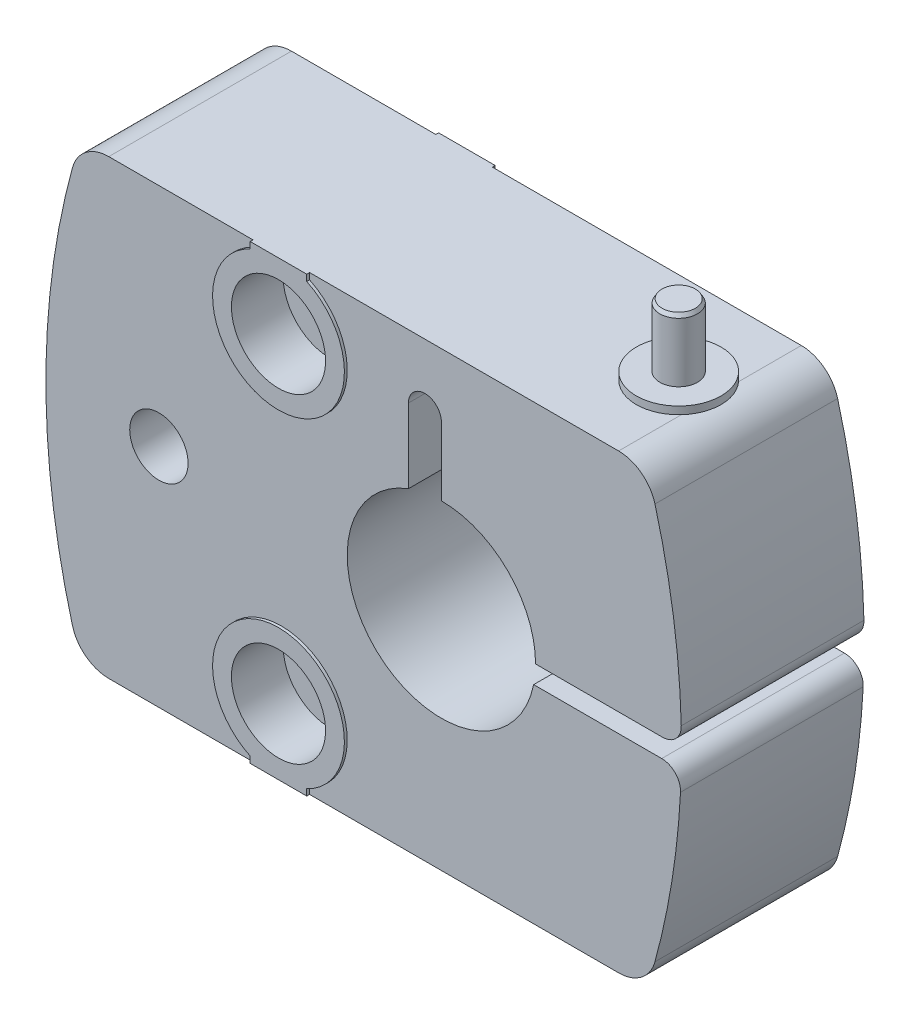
ISO-10303-21;
HEADER;
FILE_DESCRIPTION(('STEP AP214'),'2;1');
FILE_NAME('part.step','',(''),(''),'','','');
FILE_SCHEMA(('AUTOMOTIVE_DESIGN { 1 0 10303 214 1 1 1 1 }'));
ENDSEC;
DATA;
#1=APPLICATION_CONTEXT('core data for automotive mechanical design processes');
#2=APPLICATION_PROTOCOL_DEFINITION('international standard','automotive_design',2000,#1);
#3=PRODUCT_CONTEXT('',#1,'mechanical');
#4=PRODUCT('Part','Part','',(#3));
#5=PRODUCT_RELATED_PRODUCT_CATEGORY('part','',(#4));
#6=PRODUCT_DEFINITION_FORMATION('','',#4);
#7=PRODUCT_DEFINITION_CONTEXT('part definition',#1,'design');
#8=PRODUCT_DEFINITION('design','',#6,#7);
#9=PRODUCT_DEFINITION_SHAPE('','',#8);
#10=(LENGTH_UNIT() NAMED_UNIT(*) SI_UNIT(.MILLI.,.METRE.));
#11=(NAMED_UNIT(*) PLANE_ANGLE_UNIT() SI_UNIT($,.RADIAN.));
#12=(NAMED_UNIT(*) SI_UNIT($,.STERADIAN.) SOLID_ANGLE_UNIT());
#13=UNCERTAINTY_MEASURE_WITH_UNIT(LENGTH_MEASURE(1.E-05),#10,'distance_accuracy_value','');
#14=(GEOMETRIC_REPRESENTATION_CONTEXT(3) GLOBAL_UNCERTAINTY_ASSIGNED_CONTEXT((#13)) GLOBAL_UNIT_ASSIGNED_CONTEXT((#10,
#11,#12)) REPRESENTATION_CONTEXT('',''));
#15=CARTESIAN_POINT('',(0.,0.,0.));
#16=DIRECTION('',(0.,0.,1.));
#17=DIRECTION('',(1.,0.,0.));
#18=AXIS2_PLACEMENT_3D('',#15,#16,#17);
#19=CARTESIAN_POINT('',(18.8212111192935,24.,20.));
#20=DIRECTION('',(0.,-1.,0.));
#21=DIRECTION('',(0.,0.,1.));
#22=AXIS2_PLACEMENT_3D('',#19,#20,#21);
#23=PLANE('',#22);
#24=CARTESIAN_POINT('',(15.5,24.,10.));
#25=DIRECTION('',(0.,1.,0.));
#26=DIRECTION('',(0.,0.,-1.));
#27=AXIS2_PLACEMENT_3D('',#24,#25,#26);
#28=CIRCLE('',#27,4.5);
#29=CARTESIAN_POINT('',(18.8212111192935,24.,6.96362770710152));
#30=VERTEX_POINT('',#29);
#31=CARTESIAN_POINT('',(18.8212111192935,24.,13.0363722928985));
#32=VERTEX_POINT('',#31);
#33=EDGE_CURVE('E34',#30,#32,#28,.T.);
#34=ORIENTED_EDGE('',*,*,#33,.F.);
#35=DIRECTION('',(0.,0.,-1.));
#36=VECTOR('',#35,1.);
#37=CARTESIAN_POINT('',(18.8212111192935,24.,20.));
#38=LINE('',#37,#36);
#39=CARTESIAN_POINT('',(18.8212111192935,24.,0.3));
#40=VERTEX_POINT('',#39);
#41=EDGE_CURVE('E253',#30,#40,#38,.T.);
#42=ORIENTED_EDGE('',*,*,#41,.T.);
#43=DIRECTION('',(1.,0.,0.));
#44=VECTOR('',#43,1.);
#45=CARTESIAN_POINT('',(-14.,24.,0.3));
#46=LINE('',#45,#44);
#47=CARTESIAN_POINT('',(-14.,24.,0.3));
#48=VERTEX_POINT('',#47);
#49=EDGE_CURVE('E412',#48,#40,#46,.T.);
#50=ORIENTED_EDGE('',*,*,#49,.F.);
#51=DIRECTION('',(0.,0.,-1.));
#52=VECTOR('',#51,1.);
#53=CARTESIAN_POINT('',(-14.,24.,0.3));
#54=LINE('',#53,#52);
#55=CARTESIAN_POINT('',(-14.,24.,0.));
#56=VERTEX_POINT('',#55);
#57=EDGE_CURVE('E503',#48,#56,#54,.T.);
#58=ORIENTED_EDGE('',*,*,#57,.T.);
#59=DIRECTION('',(-1.,0.,0.));
#60=VECTOR('',#59,1.);
#61=CARTESIAN_POINT('',(18.8212111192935,24.,0.));
#62=LINE('',#61,#60);
#63=CARTESIAN_POINT('',(-20.,24.,0.));
#64=VERTEX_POINT('',#63);
#65=EDGE_CURVE('E496',#56,#64,#62,.T.);
#66=ORIENTED_EDGE('',*,*,#65,.T.);
#67=DIRECTION('',(0.,0.,-1.));
#68=VECTOR('',#67,1.);
#69=CARTESIAN_POINT('',(-20.,24.,0.3));
#70=LINE('',#69,#68);
#71=CARTESIAN_POINT('',(-20.,24.,0.3));
#72=VERTEX_POINT('',#71);
#73=EDGE_CURVE('E478',#72,#64,#70,.T.);
#74=ORIENTED_EDGE('',*,*,#73,.F.);
#75=DIRECTION('',(1.,0.,0.));
#76=VECTOR('',#75,1.);
#77=CARTESIAN_POINT('',(-35.3212111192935,24.,0.3));
#78=LINE('',#77,#76);
#79=CARTESIAN_POINT('',(-35.3212111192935,24.,0.3));
#80=VERTEX_POINT('',#79);
#81=EDGE_CURVE('E399',#80,#72,#78,.T.);
#82=ORIENTED_EDGE('',*,*,#81,.F.);
#83=DIRECTION('',(0.,0.,-1.));
#84=VECTOR('',#83,1.);
#85=CARTESIAN_POINT('',(-35.3212111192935,24.,20.));
#86=LINE('',#85,#84);
#87=CARTESIAN_POINT('',(-35.3212111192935,24.,19.7));
#88=VERTEX_POINT('',#87);
#89=EDGE_CURVE('E546',#88,#80,#86,.T.);
#90=ORIENTED_EDGE('',*,*,#89,.F.);
#91=DIRECTION('',(-1.,0.,0.));
#92=VECTOR('',#91,1.);
#93=CARTESIAN_POINT('',(-20.,24.,19.7));
#94=LINE('',#93,#92);
#95=CARTESIAN_POINT('',(-20.,24.,19.7));
#96=VERTEX_POINT('',#95);
#97=EDGE_CURVE('E329',#96,#88,#94,.T.);
#98=ORIENTED_EDGE('',*,*,#97,.F.);
#99=DIRECTION('',(0.,0.,1.));
#100=VECTOR('',#99,1.);
#101=CARTESIAN_POINT('',(-20.,24.,-82.5057277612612));
#102=LINE('',#101,#100);
#103=CARTESIAN_POINT('',(-20.,24.,20.));
#104=VERTEX_POINT('',#103);
#105=EDGE_CURVE('E331',#96,#104,#102,.T.);
#106=ORIENTED_EDGE('',*,*,#105,.T.);
#107=DIRECTION('',(-1.,0.,0.));
#108=VECTOR('',#107,1.);
#109=CARTESIAN_POINT('',(18.8212111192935,24.,20.));
#110=LINE('',#109,#108);
#111=CARTESIAN_POINT('',(-14.,24.,20.));
#112=VERTEX_POINT('',#111);
#113=EDGE_CURVE('E511',#112,#104,#110,.T.);
#114=ORIENTED_EDGE('',*,*,#113,.F.);
#115=DIRECTION('',(0.,0.,1.));
#116=VECTOR('',#115,1.);
#117=CARTESIAN_POINT('',(-14.,24.,-82.5057277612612));
#118=LINE('',#117,#116);
#119=CARTESIAN_POINT('',(-14.,24.,19.7));
#120=VERTEX_POINT('',#119);
#121=EDGE_CURVE('E343',#120,#112,#118,.T.);
#122=ORIENTED_EDGE('',*,*,#121,.F.);
#123=DIRECTION('',(-1.,0.,0.));
#124=VECTOR('',#123,1.);
#125=CARTESIAN_POINT('',(18.8212111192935,24.,19.7));
#126=LINE('',#125,#124);
#127=CARTESIAN_POINT('',(18.8212111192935,24.,19.7));
#128=VERTEX_POINT('',#127);
#129=EDGE_CURVE('E249',#128,#120,#126,.T.);
#130=ORIENTED_EDGE('',*,*,#129,.F.);
#131=EDGE_CURVE('E245',#128,#32,#38,.T.);
#132=ORIENTED_EDGE('',*,*,#131,.T.);
#133=EDGE_LOOP('',(#34,#42,#50,#58,#66,#74,#82,#90,#98,#106,#114,#122,#130,#132));
#134=FACE_BOUND('',#133,.T.);
#135=ADVANCED_FACE('F18',(#134),#23,.F.);
#136=CARTESIAN_POINT('',(-17.,17.,20.));
#137=DIRECTION('',(0.,0.,-1.));
#138=DIRECTION('',(0.,-1.,0.));
#139=AXIS2_PLACEMENT_3D('',#136,#137,#138);
#140=CYLINDRICAL_SURFACE('',#139,2.75);
#141=CARTESIAN_POINT('',(-17.,17.,5.5));
#142=DIRECTION('',(0.,0.,-1.));
#143=DIRECTION('',(0.,-1.,0.));
#144=AXIS2_PLACEMENT_3D('',#141,#142,#143);
#145=CIRCLE('',#144,2.75);
#146=CARTESIAN_POINT('',(-17.,14.25,5.5));
#147=VERTEX_POINT('',#146);
#148=EDGE_CURVE('E304',#147,#147,#145,.T.);
#149=ORIENTED_EDGE('',*,*,#148,.T.);
#150=EDGE_LOOP('',(#149));
#151=FACE_BOUND('',#150,.T.);
#152=CARTESIAN_POINT('',(-17.,17.,14.5));
#153=DIRECTION('',(0.,0.,1.));
#154=DIRECTION('',(0.,1.,0.));
#155=AXIS2_PLACEMENT_3D('',#152,#153,#154);
#156=CIRCLE('',#155,2.75);
#157=CARTESIAN_POINT('',(-17.,19.75,14.5));
#158=VERTEX_POINT('',#157);
#159=EDGE_CURVE('E284',#158,#158,#156,.T.);
#160=ORIENTED_EDGE('',*,*,#159,.T.);
#161=EDGE_LOOP('',(#160));
#162=FACE_BOUND('',#161,.T.);
#163=ADVANCED_FACE('F588',(#151,#162),#140,.F.);
#164=CARTESIAN_POINT('',(-17.,-17.,20.));
#165=DIRECTION('',(0.,0.,-1.));
#166=DIRECTION('',(0.,-1.,0.));
#167=AXIS2_PLACEMENT_3D('',#164,#165,#166);
#168=CYLINDRICAL_SURFACE('',#167,2.75);
#169=CARTESIAN_POINT('',(-17.,-17.,5.5));
#170=DIRECTION('',(0.,0.,-1.));
#171=DIRECTION('',(0.,-1.,0.));
#172=AXIS2_PLACEMENT_3D('',#169,#170,#171);
#173=CIRCLE('',#172,2.75);
#174=CARTESIAN_POINT('',(-17.,-19.75,5.5));
#175=VERTEX_POINT('',#174);
#176=EDGE_CURVE('E297',#175,#175,#173,.T.);
#177=ORIENTED_EDGE('',*,*,#176,.T.);
#178=EDGE_LOOP('',(#177));
#179=FACE_BOUND('',#178,.T.);
#180=CARTESIAN_POINT('',(-17.,-17.,14.5));
#181=DIRECTION('',(0.,0.,1.));
#182=DIRECTION('',(0.,1.,0.));
#183=AXIS2_PLACEMENT_3D('',#180,#181,#182);
#184=CIRCLE('',#183,2.75);
#185=CARTESIAN_POINT('',(-17.,-14.25,14.5));
#186=VERTEX_POINT('',#185);
#187=EDGE_CURVE('E290',#186,#186,#184,.T.);
#188=ORIENTED_EDGE('',*,*,#187,.T.);
#189=EDGE_LOOP('',(#188));
#190=FACE_BOUND('',#189,.T.);
#191=ADVANCED_FACE('F594',(#179,#190),#168,.F.);
#192=CARTESIAN_POINT('',(0.,0.,20.));
#193=DIRECTION('',(0.,0.,1.));
#194=DIRECTION('',(0.,1.,0.));
#195=AXIS2_PLACEMENT_3D('',#192,#193,#194);
#196=PLANE('',#195);
#197=CARTESIAN_POINT('',(-17.,-17.,20.));
#198=DIRECTION('',(0.,0.,1.));
#199=DIRECTION('',(0.,1.,0.));
#200=AXIS2_PLACEMENT_3D('',#197,#198,#199);
#201=CIRCLE('',#200,5.);
#202=CARTESIAN_POINT('',(-17.,-12.,20.));
#203=VERTEX_POINT('',#202);
#204=EDGE_CURVE('E291',#203,#203,#201,.T.);
#205=ORIENTED_EDGE('',*,*,#204,.F.);
#206=EDGE_LOOP('',(#205));
#207=FACE_BOUND('',#206,.T.);
#208=DIRECTION('',(0.,1.,0.));
#209=VECTOR('',#208,1.);
#210=CARTESIAN_POINT('',(-20.,-24.,20.));
#211=LINE('',#210,#209);
#212=CARTESIAN_POINT('',(-20.,-24.,20.));
#213=VERTEX_POINT('',#212);
#214=CARTESIAN_POINT('',(-20.,-23.3245553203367,20.));
#215=VERTEX_POINT('',#214);
#216=EDGE_CURVE('E321',#213,#215,#211,.T.);
#217=ORIENTED_EDGE('',*,*,#216,.F.);
#218=DIRECTION('',(1.,0.,0.));
#219=VECTOR('',#218,1.);
#220=CARTESIAN_POINT('',(-35.3212111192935,-24.,20.));
#221=LINE('',#220,#219);
#222=CARTESIAN_POINT('',(-14.,-24.,20.));
#223=VERTEX_POINT('',#222);
#224=EDGE_CURVE('E514',#213,#223,#221,.T.);
#225=ORIENTED_EDGE('',*,*,#224,.T.);
#226=DIRECTION('',(0.,-1.,0.));
#227=VECTOR('',#226,1.);
#228=CARTESIAN_POINT('',(-14.,-23.3245553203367,20.));
#229=LINE('',#228,#227);
#230=CARTESIAN_POINT('',(-14.,-23.3245553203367,20.));
#231=VERTEX_POINT('',#230);
#232=EDGE_CURVE('E42',#231,#223,#229,.T.);
#233=ORIENTED_EDGE('',*,*,#232,.F.);
#234=CARTESIAN_POINT('',(-17.,-17.,20.));
#235=DIRECTION('',(0.,0.,-1.));
#236=DIRECTION('',(0.,1.,0.));
#237=AXIS2_PLACEMENT_3D('',#234,#235,#236);
#238=CIRCLE('',#237,7.);
#239=EDGE_CURVE('E318',#215,#231,#238,.T.);
#240=ORIENTED_EDGE('',*,*,#239,.F.);
#241=EDGE_LOOP('',(#217,#225,#233,#240));
#242=FACE_BOUND('',#241,.T.);
#243=ADVANCED_FACE('F622',(#207,#242),#196,.T.);
#244=CARTESIAN_POINT('',(0.,0.,0.));
#245=DIRECTION('',(0.,0.,1.));
#246=DIRECTION('',(0.,1.,0.));
#247=AXIS2_PLACEMENT_3D('',#244,#245,#246);
#248=PLANE('',#247);
#249=CARTESIAN_POINT('',(-17.,-17.,0.));
#250=DIRECTION('',(0.,0.,-1.));
#251=DIRECTION('',(0.,-1.,0.));
#252=AXIS2_PLACEMENT_3D('',#249,#250,#251);
#253=CIRCLE('',#252,5.);
#254=CARTESIAN_POINT('',(-17.,-22.,0.));
#255=VERTEX_POINT('',#254);
#256=EDGE_CURVE('E298',#255,#255,#253,.T.);
#257=ORIENTED_EDGE('',*,*,#256,.F.);
#258=EDGE_LOOP('',(#257));
#259=FACE_BOUND('',#258,.T.);
#260=DIRECTION('',(1.,0.,0.));
#261=VECTOR('',#260,1.);
#262=CARTESIAN_POINT('',(-35.3212111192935,-24.,0.));
#263=LINE('',#262,#261);
#264=CARTESIAN_POINT('',(-20.,-24.,0.));
#265=VERTEX_POINT('',#264);
#266=CARTESIAN_POINT('',(-14.,-24.,0.));
#267=VERTEX_POINT('',#266);
#268=EDGE_CURVE('E515',#265,#267,#263,.T.);
#269=ORIENTED_EDGE('',*,*,#268,.F.);
#270=DIRECTION('',(0.,-1.,0.));
#271=VECTOR('',#270,1.);
#272=CARTESIAN_POINT('',(-20.,-23.3245553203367,0.));
#273=LINE('',#272,#271);
#274=CARTESIAN_POINT('',(-20.,-23.3245553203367,0.));
#275=VERTEX_POINT('',#274);
#276=EDGE_CURVE('E403',#275,#265,#273,.T.);
#277=ORIENTED_EDGE('',*,*,#276,.F.);
#278=CARTESIAN_POINT('',(-17.,-17.,0.));
#279=DIRECTION('',(0.,0.,1.));
#280=DIRECTION('',(0.,1.,0.));
#281=AXIS2_PLACEMENT_3D('',#278,#279,#280);
#282=CIRCLE('',#281,7.);
#283=CARTESIAN_POINT('',(-14.,-23.3245553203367,0.));
#284=VERTEX_POINT('',#283);
#285=EDGE_CURVE('E489',#284,#275,#282,.T.);
#286=ORIENTED_EDGE('',*,*,#285,.F.);
#287=DIRECTION('',(0.,1.,0.));
#288=VECTOR('',#287,1.);
#289=CARTESIAN_POINT('',(-14.,-23.3245553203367,0.));
#290=LINE('',#289,#288);
#291=EDGE_CURVE('E486',#267,#284,#290,.T.);
#292=ORIENTED_EDGE('',*,*,#291,.F.);
#293=EDGE_LOOP('',(#269,#277,#286,#292));
#294=FACE_BOUND('',#293,.T.);
#295=ADVANCED_FACE('F616',(#259,#294),#248,.F.);
#296=CARTESIAN_POINT('',(0.,0.,20.));
#297=DIRECTION('',(0.,0.,-1.));
#298=DIRECTION('',(0.,-1.,0.));
#299=AXIS2_PLACEMENT_3D('',#296,#297,#298);
#300=CYLINDRICAL_SURFACE('',#299,10.);
#301=DIRECTION('',(0.,0.,-1.));
#302=VECTOR('',#301,1.);
#303=CARTESIAN_POINT('',(10.,0.,20.));
#304=LINE('',#303,#302);
#305=CARTESIAN_POINT('',(10.,0.,19.7));
#306=VERTEX_POINT('',#305);
#307=CARTESIAN_POINT('',(10.,0.,0.3));
#308=VERTEX_POINT('',#307);
#309=EDGE_CURVE('E553',#306,#308,#304,.T.);
#310=ORIENTED_EDGE('',*,*,#309,.F.);
#311=CARTESIAN_POINT('',(0.,0.,19.7));
#312=DIRECTION('',(0.,0.,-1.));
#313=DIRECTION('',(0.,-1.,0.));
#314=AXIS2_PLACEMENT_3D('',#311,#312,#313);
#315=CIRCLE('',#314,10.);
#316=CARTESIAN_POINT('',(0.,10.,19.7));
#317=VERTEX_POINT('',#316);
#318=EDGE_CURVE('E353',#317,#306,#315,.T.);
#319=ORIENTED_EDGE('',*,*,#318,.F.);
#320=DIRECTION('',(0.,0.,-1.));
#321=VECTOR('',#320,1.);
#322=CARTESIAN_POINT('',(0.,10.,20.));
#323=LINE('',#322,#321);
#324=CARTESIAN_POINT('',(0.,10.,0.3));
#325=VERTEX_POINT('',#324);
#326=EDGE_CURVE('E518',#317,#325,#323,.T.);
#327=ORIENTED_EDGE('',*,*,#326,.T.);
#328=CARTESIAN_POINT('',(0.,0.,0.3));
#329=DIRECTION('',(0.,0.,1.));
#330=DIRECTION('',(0.,-1.,0.));
#331=AXIS2_PLACEMENT_3D('',#328,#329,#330);
#332=CIRCLE('',#331,10.);
#333=EDGE_CURVE('E427',#308,#325,#332,.T.);
#334=ORIENTED_EDGE('',*,*,#333,.F.);
#335=EDGE_LOOP('',(#310,#319,#327,#334));
#336=FACE_BOUND('',#335,.T.);
#337=ADVANCED_FACE('F613',(#336),#300,.F.);
#338=CARTESIAN_POINT('',(10.,0.,20.));
#339=DIRECTION('',(0.,1.,0.));
#340=DIRECTION('',(-1.,0.,0.));
#341=AXIS2_PLACEMENT_3D('',#338,#339,#340);
#342=PLANE('',#341);
#343=CARTESIAN_POINT('',(15.5,0.,10.));
#344=DIRECTION('',(0.,1.,0.));
#345=DIRECTION('',(-1.,0.,0.));
#346=AXIS2_PLACEMENT_3D('',#343,#344,#345);
#347=CIRCLE('',#346,2.);
#348=CARTESIAN_POINT('',(13.5,0.,10.));
#349=VERTEX_POINT('',#348);
#350=EDGE_CURVE('E277',#349,#349,#347,.T.);
#351=ORIENTED_EDGE('',*,*,#350,.T.);
#352=EDGE_LOOP('',(#351));
#353=FACE_BOUND('',#352,.T.);
#354=DIRECTION('',(0.,0.,-1.));
#355=VECTOR('',#354,1.);
#356=CARTESIAN_POINT('',(23.4743547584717,0.,20.));
#357=LINE('',#356,#355);
#358=CARTESIAN_POINT('',(23.4743547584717,0.,19.7));
#359=VERTEX_POINT('',#358);
#360=CARTESIAN_POINT('',(23.4743547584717,0.,0.3));
#361=VERTEX_POINT('',#360);
#362=EDGE_CURVE('E551',#359,#361,#357,.T.);
#363=ORIENTED_EDGE('',*,*,#362,.F.);
#364=DIRECTION('',(1.,0.,0.));
#365=VECTOR('',#364,1.);
#366=CARTESIAN_POINT('',(10.,0.,19.7));
#367=LINE('',#366,#365);
#368=EDGE_CURVE('E351',#306,#359,#367,.T.);
#369=ORIENTED_EDGE('',*,*,#368,.F.);
#370=ORIENTED_EDGE('',*,*,#309,.T.);
#371=DIRECTION('',(-1.,0.,0.));
#372=VECTOR('',#371,1.);
#373=CARTESIAN_POINT('',(23.4743547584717,0.,0.3));
#374=LINE('',#373,#372);
#375=EDGE_CURVE('E424',#361,#308,#374,.T.);
#376=ORIENTED_EDGE('',*,*,#375,.F.);
#377=EDGE_LOOP('',(#363,#369,#370,#376));
#378=FACE_BOUND('',#377,.T.);
#379=ADVANCED_FACE('F610',(#353,#378),#342,.F.);
#380=CARTESIAN_POINT('',(23.4743547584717,2.,20.));
#381=DIRECTION('',(0.,0.,-1.));
#382=DIRECTION('',(0.,-1.,0.));
#383=AXIS2_PLACEMENT_3D('',#380,#381,#382);
#384=CYLINDRICAL_SURFACE('',#383,2.);
#385=DIRECTION('',(0.,0.,-1.));
#386=VECTOR('',#385,1.);
#387=CARTESIAN_POINT('',(25.4736971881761,2.05128205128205,20.));
#388=LINE('',#387,#386);
#389=CARTESIAN_POINT('',(25.4736971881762,2.05128205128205,19.7));
#390=VERTEX_POINT('',#389);
#391=CARTESIAN_POINT('',(25.4736971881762,2.05128205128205,0.3));
#392=VERTEX_POINT('',#391);
#393=EDGE_CURVE('E549',#390,#392,#388,.T.);
#394=ORIENTED_EDGE('',*,*,#393,.F.);
#395=CARTESIAN_POINT('',(23.4743547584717,2.,19.7));
#396=DIRECTION('',(0.,0.,-1.));
#397=DIRECTION('',(0.,-1.,0.));
#398=AXIS2_PLACEMENT_3D('',#395,#396,#397);
#399=CIRCLE('',#398,2.);
#400=EDGE_CURVE('E349',#359,#390,#399,.F.);
#401=ORIENTED_EDGE('',*,*,#400,.F.);
#402=ORIENTED_EDGE('',*,*,#362,.T.);
#403=CARTESIAN_POINT('',(23.4743547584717,2.,0.3));
#404=DIRECTION('',(0.,0.,-1.));
#405=DIRECTION('',(0.,-1.,0.));
#406=AXIS2_PLACEMENT_3D('',#403,#404,#405);
#407=CIRCLE('',#406,2.);
#408=EDGE_CURVE('E421',#392,#361,#407,.T.);
#409=ORIENTED_EDGE('',*,*,#408,.F.);
#410=EDGE_LOOP('',(#394,#401,#402,#409));
#411=FACE_BOUND('',#410,.T.);
#412=ADVANCED_FACE('F606',(#411),#384,.T.);
#413=CARTESIAN_POINT('',(-54.5,0.,20.));
#414=DIRECTION('',(0.,0.,-1.));
#415=DIRECTION('',(0.,-1.,0.));
#416=AXIS2_PLACEMENT_3D('',#413,#414,#415);
#417=CYLINDRICAL_SURFACE('',#416,80.);
#418=DIRECTION('',(0.,0.,-1.));
#419=VECTOR('',#418,1.);
#420=CARTESIAN_POINT('',(22.6802222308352,21.0526315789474,20.));
#421=LINE('',#420,#419);
#422=CARTESIAN_POINT('',(22.6802222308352,21.0526315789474,19.7));
#423=VERTEX_POINT('',#422);
#424=CARTESIAN_POINT('',(22.6802222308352,21.0526315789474,0.3));
#425=VERTEX_POINT('',#424);
#426=EDGE_CURVE('E252',#423,#425,#421,.T.);
#427=ORIENTED_EDGE('',*,*,#426,.F.);
#428=CARTESIAN_POINT('',(-54.5,0.,19.7));
#429=DIRECTION('',(0.,0.,-1.));
#430=DIRECTION('',(0.,-1.,0.));
#431=AXIS2_PLACEMENT_3D('',#428,#429,#430);
#432=CIRCLE('',#431,80.);
#433=EDGE_CURVE('E347',#390,#423,#432,.F.);
#434=ORIENTED_EDGE('',*,*,#433,.F.);
#435=ORIENTED_EDGE('',*,*,#393,.T.);
#436=CARTESIAN_POINT('',(-54.5,0.,0.3));
#437=DIRECTION('',(0.,0.,-1.));
#438=DIRECTION('',(0.,-1.,0.));
#439=AXIS2_PLACEMENT_3D('',#436,#437,#438);
#440=CIRCLE('',#439,80.);
#441=EDGE_CURVE('E418',#425,#392,#440,.T.);
#442=ORIENTED_EDGE('',*,*,#441,.F.);
#443=EDGE_LOOP('',(#427,#434,#435,#442));
#444=FACE_BOUND('',#443,.T.);
#445=ADVANCED_FACE('F603',(#444),#417,.T.);
#446=CARTESIAN_POINT('',(18.8212111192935,20.,20.));
#447=DIRECTION('',(0.,0.,-1.));
#448=DIRECTION('',(0.,-1.,0.));
#449=AXIS2_PLACEMENT_3D('',#446,#447,#448);
#450=CYLINDRICAL_SURFACE('',#449,4.);
#451=ORIENTED_EDGE('',*,*,#131,.F.);
#452=CARTESIAN_POINT('',(18.8212111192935,20.,19.7));
#453=DIRECTION('',(0.,0.,-1.));
#454=DIRECTION('',(0.,-1.,0.));
#455=AXIS2_PLACEMENT_3D('',#452,#453,#454);
#456=CIRCLE('',#455,4.);
#457=EDGE_CURVE('E345',#423,#128,#456,.F.);
#458=ORIENTED_EDGE('',*,*,#457,.F.);
#459=ORIENTED_EDGE('',*,*,#426,.T.);
#460=CARTESIAN_POINT('',(18.8212111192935,20.,0.3));
#461=DIRECTION('',(0.,0.,-1.));
#462=DIRECTION('',(0.,-1.,0.));
#463=AXIS2_PLACEMENT_3D('',#460,#461,#462);
#464=CIRCLE('',#463,4.);
#465=EDGE_CURVE('E415',#40,#425,#464,.T.);
#466=ORIENTED_EDGE('',*,*,#465,.F.);
#467=ORIENTED_EDGE('',*,*,#41,.F.);
#468=DIRECTION('',(0.,0.,-1.));
#469=VECTOR('',#468,1.);
#470=CARTESIAN_POINT('',(18.8212111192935,24.,20.));
#471=LINE('',#470,#469);
#472=EDGE_CURVE('E256',#32,#30,#471,.T.);
#473=ORIENTED_EDGE('',*,*,#472,.F.);
#474=EDGE_LOOP('',(#451,#458,#459,#466,#467,#473));
#475=FACE_BOUND('',#474,.T.);
#476=ADVANCED_FACE('F257',(#475),#450,.T.);
#477=CARTESIAN_POINT('',(-35.3212111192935,20.,20.));
#478=DIRECTION('',(0.,0.,-1.));
#479=DIRECTION('',(0.,-1.,0.));
#480=AXIS2_PLACEMENT_3D('',#477,#478,#479);
#481=CYLINDRICAL_SURFACE('',#480,4.);
#482=DIRECTION('',(0.,0.,-1.));
#483=VECTOR('',#482,1.);
#484=CARTESIAN_POINT('',(-39.1802222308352,21.0526315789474,20.));
#485=LINE('',#484,#483);
#486=CARTESIAN_POINT('',(-39.1802222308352,21.0526315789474,19.7));
#487=VERTEX_POINT('',#486);
#488=CARTESIAN_POINT('',(-39.1802222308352,21.0526315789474,0.3));
#489=VERTEX_POINT('',#488);
#490=EDGE_CURVE('E544',#487,#489,#485,.T.);
#491=ORIENTED_EDGE('',*,*,#490,.F.);
#492=CARTESIAN_POINT('',(-35.3212111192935,20.,19.7));
#493=DIRECTION('',(0.,0.,-1.));
#494=DIRECTION('',(0.,-1.,0.));
#495=AXIS2_PLACEMENT_3D('',#492,#493,#494);
#496=CIRCLE('',#495,4.);
#497=EDGE_CURVE('E326',#88,#487,#496,.F.);
#498=ORIENTED_EDGE('',*,*,#497,.F.);
#499=ORIENTED_EDGE('',*,*,#89,.T.);
#500=CARTESIAN_POINT('',(-35.3212111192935,20.,0.3));
#501=DIRECTION('',(0.,0.,-1.));
#502=DIRECTION('',(0.,-1.,0.));
#503=AXIS2_PLACEMENT_3D('',#500,#501,#502);
#504=CIRCLE('',#503,4.);
#505=EDGE_CURVE('E475',#489,#80,#504,.T.);
#506=ORIENTED_EDGE('',*,*,#505,.F.);
#507=EDGE_LOOP('',(#491,#498,#499,#506));
#508=FACE_BOUND('',#507,.T.);
#509=ADVANCED_FACE('F599',(#508),#481,.T.);
#510=CARTESIAN_POINT('',(38.,0.,20.));
#511=DIRECTION('',(0.,0.,-1.));
#512=DIRECTION('',(0.,-1.,0.));
#513=AXIS2_PLACEMENT_3D('',#510,#511,#512);
#514=CYLINDRICAL_SURFACE('',#513,80.);
#515=DIRECTION('',(0.,0.,-1.));
#516=VECTOR('',#515,1.);
#517=CARTESIAN_POINT('',(-39.1802222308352,-21.0526315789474,20.));
#518=LINE('',#517,#516);
#519=CARTESIAN_POINT('',(-39.1802222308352,-21.0526315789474,19.7));
#520=VERTEX_POINT('',#519);
#521=CARTESIAN_POINT('',(-39.1802222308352,-21.0526315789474,0.3));
#522=VERTEX_POINT('',#521);
#523=EDGE_CURVE('E542',#520,#522,#518,.T.);
#524=ORIENTED_EDGE('',*,*,#523,.F.);
#525=CARTESIAN_POINT('',(38.,0.,19.7));
#526=DIRECTION('',(0.,0.,-1.));
#527=DIRECTION('',(0.,-1.,0.));
#528=AXIS2_PLACEMENT_3D('',#525,#526,#527);
#529=CIRCLE('',#528,80.);
#530=EDGE_CURVE('E310',#487,#520,#529,.F.);
#531=ORIENTED_EDGE('',*,*,#530,.F.);
#532=ORIENTED_EDGE('',*,*,#490,.T.);
#533=CARTESIAN_POINT('',(38.,0.,0.3));
#534=DIRECTION('',(0.,0.,-1.));
#535=DIRECTION('',(0.,-1.,0.));
#536=AXIS2_PLACEMENT_3D('',#533,#534,#535);
#537=CIRCLE('',#536,80.);
#538=EDGE_CURVE('E472',#522,#489,#537,.T.);
#539=ORIENTED_EDGE('',*,*,#538,.F.);
#540=EDGE_LOOP('',(#524,#531,#532,#539));
#541=FACE_BOUND('',#540,.T.);
#542=ADVANCED_FACE('F669',(#541),#514,.T.);
#543=CARTESIAN_POINT('',(-35.3212111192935,-20.,20.));
#544=DIRECTION('',(0.,0.,-1.));
#545=DIRECTION('',(0.,-1.,0.));
#546=AXIS2_PLACEMENT_3D('',#543,#544,#545);
#547=CYLINDRICAL_SURFACE('',#546,4.);
#548=DIRECTION('',(0.,0.,-1.));
#549=VECTOR('',#548,1.);
#550=CARTESIAN_POINT('',(-35.3212111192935,-24.,20.));
#551=LINE('',#550,#549);
#552=CARTESIAN_POINT('',(-35.3212111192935,-24.,19.7));
#553=VERTEX_POINT('',#552);
#554=CARTESIAN_POINT('',(-35.3212111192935,-24.,0.3));
#555=VERTEX_POINT('',#554);
#556=EDGE_CURVE('E540',#553,#555,#551,.T.);
#557=ORIENTED_EDGE('',*,*,#556,.F.);
#558=CARTESIAN_POINT('',(-35.3212111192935,-20.,19.7));
#559=DIRECTION('',(0.,0.,-1.));
#560=DIRECTION('',(0.,-1.,0.));
#561=AXIS2_PLACEMENT_3D('',#558,#559,#560);
#562=CIRCLE('',#561,4.);
#563=EDGE_CURVE('E325',#520,#553,#562,.F.);
#564=ORIENTED_EDGE('',*,*,#563,.F.);
#565=ORIENTED_EDGE('',*,*,#523,.T.);
#566=CARTESIAN_POINT('',(-35.3212111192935,-20.,0.3));
#567=DIRECTION('',(0.,0.,-1.));
#568=DIRECTION('',(0.,-1.,0.));
#569=AXIS2_PLACEMENT_3D('',#566,#567,#568);
#570=CIRCLE('',#569,4.);
#571=EDGE_CURVE('E469',#555,#522,#570,.T.);
#572=ORIENTED_EDGE('',*,*,#571,.F.);
#573=EDGE_LOOP('',(#557,#564,#565,#572));
#574=FACE_BOUND('',#573,.T.);
#575=ADVANCED_FACE('F673',(#574),#547,.T.);
#576=CARTESIAN_POINT('',(18.8212111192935,-20.,20.));
#577=DIRECTION('',(0.,0.,-1.));
#578=DIRECTION('',(0.,-1.,0.));
#579=AXIS2_PLACEMENT_3D('',#576,#577,#578);
#580=CYLINDRICAL_SURFACE('',#579,4.);
#581=DIRECTION('',(0.,0.,-1.));
#582=VECTOR('',#581,1.);
#583=CARTESIAN_POINT('',(22.6802222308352,-21.0526315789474,20.));
#584=LINE('',#583,#582);
#585=CARTESIAN_POINT('',(22.6802222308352,-21.0526315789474,19.7));
#586=VERTEX_POINT('',#585);
#587=CARTESIAN_POINT('',(22.6802222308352,-21.0526315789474,0.3));
#588=VERTEX_POINT('',#587);
#589=EDGE_CURVE('E536',#586,#588,#584,.T.);
#590=ORIENTED_EDGE('',*,*,#589,.F.);
#591=CARTESIAN_POINT('',(18.8212111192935,-20.,19.7));
#592=DIRECTION('',(0.,0.,-1.));
#593=DIRECTION('',(0.,-1.,0.));
#594=AXIS2_PLACEMENT_3D('',#591,#592,#593);
#595=CIRCLE('',#594,4.);
#596=CARTESIAN_POINT('',(18.8212111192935,-24.,19.7));
#597=VERTEX_POINT('',#596);
#598=EDGE_CURVE('E369',#597,#586,#595,.F.);
#599=ORIENTED_EDGE('',*,*,#598,.F.);
#600=DIRECTION('',(0.,0.,-1.));
#601=VECTOR('',#600,1.);
#602=CARTESIAN_POINT('',(18.8212111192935,-24.,20.));
#603=LINE('',#602,#601);
#604=CARTESIAN_POINT('',(18.8212111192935,-24.,0.3));
#605=VERTEX_POINT('',#604);
#606=EDGE_CURVE('E538',#597,#605,#603,.T.);
#607=ORIENTED_EDGE('',*,*,#606,.T.);
#608=CARTESIAN_POINT('',(18.8212111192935,-20.,0.3));
#609=DIRECTION('',(0.,0.,-1.));
#610=DIRECTION('',(0.,-1.,0.));
#611=AXIS2_PLACEMENT_3D('',#608,#609,#610);
#612=CIRCLE('',#611,4.);
#613=EDGE_CURVE('E451',#588,#605,#612,.T.);
#614=ORIENTED_EDGE('',*,*,#613,.F.);
#615=EDGE_LOOP('',(#590,#599,#607,#614));
#616=FACE_BOUND('',#615,.T.);
#617=ADVANCED_FACE('F699',(#616),#580,.T.);
#618=CARTESIAN_POINT('',(-54.5,0.,20.));
#619=DIRECTION('',(0.,0.,-1.));
#620=DIRECTION('',(0.,-1.,0.));
#621=AXIS2_PLACEMENT_3D('',#618,#619,#620);
#622=CYLINDRICAL_SURFACE('',#621,80.);
#623=DIRECTION('',(0.,0.,-1.));
#624=VECTOR('',#623,1.);
#625=CARTESIAN_POINT('',(25.3947367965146,-4.1025641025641,20.));
#626=LINE('',#625,#624);
#627=CARTESIAN_POINT('',(25.3947367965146,-4.1025641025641,19.7));
#628=VERTEX_POINT('',#627);
#629=CARTESIAN_POINT('',(25.3947367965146,-4.1025641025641,0.3));
#630=VERTEX_POINT('',#629);
#631=EDGE_CURVE('E534',#628,#630,#626,.T.);
#632=ORIENTED_EDGE('',*,*,#631,.F.);
#633=CARTESIAN_POINT('',(-54.5,0.,19.7));
#634=DIRECTION('',(0.,0.,-1.));
#635=DIRECTION('',(0.,-1.,0.));
#636=AXIS2_PLACEMENT_3D('',#633,#634,#635);
#637=CIRCLE('',#636,80.);
#638=EDGE_CURVE('E367',#586,#628,#637,.F.);
#639=ORIENTED_EDGE('',*,*,#638,.F.);
#640=ORIENTED_EDGE('',*,*,#589,.T.);
#641=CARTESIAN_POINT('',(-54.5,0.,0.3));
#642=DIRECTION('',(0.,0.,-1.));
#643=DIRECTION('',(0.,-1.,0.));
#644=AXIS2_PLACEMENT_3D('',#641,#642,#643);
#645=CIRCLE('',#644,80.);
#646=EDGE_CURVE('E448',#630,#588,#645,.T.);
#647=ORIENTED_EDGE('',*,*,#646,.F.);
#648=EDGE_LOOP('',(#632,#639,#640,#647));
#649=FACE_BOUND('',#648,.T.);
#650=ADVANCED_FACE('F704',(#649),#622,.T.);
#651=CARTESIAN_POINT('',(23.3973683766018,-4.,20.));
#652=DIRECTION('',(0.,0.,-1.));
#653=DIRECTION('',(0.,-1.,0.));
#654=AXIS2_PLACEMENT_3D('',#651,#652,#653);
#655=CYLINDRICAL_SURFACE('',#654,2.);
#656=DIRECTION('',(0.,0.,-1.));
#657=VECTOR('',#656,1.);
#658=CARTESIAN_POINT('',(23.3973683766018,-2.,20.));
#659=LINE('',#658,#657);
#660=CARTESIAN_POINT('',(23.3973683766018,-2.,19.7));
#661=VERTEX_POINT('',#660);
#662=CARTESIAN_POINT('',(23.3973683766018,-2.,0.3));
#663=VERTEX_POINT('',#662);
#664=EDGE_CURVE('E532',#661,#663,#659,.T.);
#665=ORIENTED_EDGE('',*,*,#664,.F.);
#666=CARTESIAN_POINT('',(23.3973683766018,-4.,19.7));
#667=DIRECTION('',(0.,0.,-1.));
#668=DIRECTION('',(0.,-1.,0.));
#669=AXIS2_PLACEMENT_3D('',#666,#667,#668);
#670=CIRCLE('',#669,2.);
#671=EDGE_CURVE('E365',#628,#661,#670,.F.);
#672=ORIENTED_EDGE('',*,*,#671,.F.);
#673=ORIENTED_EDGE('',*,*,#631,.T.);
#674=CARTESIAN_POINT('',(23.3973683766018,-4.,0.3));
#675=DIRECTION('',(0.,0.,-1.));
#676=DIRECTION('',(0.,-1.,0.));
#677=AXIS2_PLACEMENT_3D('',#674,#675,#676);
#678=CIRCLE('',#677,2.);
#679=EDGE_CURVE('E445',#663,#630,#678,.T.);
#680=ORIENTED_EDGE('',*,*,#679,.F.);
#681=EDGE_LOOP('',(#665,#672,#673,#680));
#682=FACE_BOUND('',#681,.T.);
#683=ADVANCED_FACE('F710',(#682),#655,.T.);
#684=CARTESIAN_POINT('',(23.3973683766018,-2.,20.));
#685=DIRECTION('',(0.,-1.,0.));
#686=DIRECTION('',(1.,0.,0.));
#687=AXIS2_PLACEMENT_3D('',#684,#685,#686);
#688=PLANE('',#687);
#689=CARTESIAN_POINT('',(15.5,-2.00000000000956,10.));
#690=DIRECTION('',(0.,-1.,0.));
#691=DIRECTION('',(1.,0.,0.));
#692=AXIS2_PLACEMENT_3D('',#689,#690,#691);
#693=CIRCLE('',#692,2.);
#694=CARTESIAN_POINT('',(17.5,-2.00000000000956,10.));
#695=VERTEX_POINT('',#694);
#696=EDGE_CURVE('E262',#695,#695,#693,.F.);
#697=ORIENTED_EDGE('',*,*,#696,.F.);
#698=EDGE_LOOP('',(#697));
#699=FACE_BOUND('',#698,.T.);
#700=DIRECTION('',(0.,0.,-1.));
#701=VECTOR('',#700,1.);
#702=CARTESIAN_POINT('',(9.7979589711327,-2.,20.));
#703=LINE('',#702,#701);
#704=CARTESIAN_POINT('',(9.7979589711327,-2.,19.7));
#705=VERTEX_POINT('',#704);
#706=CARTESIAN_POINT('',(9.7979589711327,-2.,0.3));
#707=VERTEX_POINT('',#706);
#708=EDGE_CURVE('E530',#705,#707,#703,.T.);
#709=ORIENTED_EDGE('',*,*,#708,.F.);
#710=DIRECTION('',(-1.,0.,0.));
#711=VECTOR('',#710,1.);
#712=CARTESIAN_POINT('',(23.3973683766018,-2.,19.7));
#713=LINE('',#712,#711);
#714=EDGE_CURVE('E363',#661,#705,#713,.T.);
#715=ORIENTED_EDGE('',*,*,#714,.F.);
#716=ORIENTED_EDGE('',*,*,#664,.T.);
#717=DIRECTION('',(1.,0.,0.));
#718=VECTOR('',#717,1.);
#719=CARTESIAN_POINT('',(9.7979589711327,-2.,0.3));
#720=LINE('',#719,#718);
#721=EDGE_CURVE('E442',#707,#663,#720,.T.);
#722=ORIENTED_EDGE('',*,*,#721,.F.);
#723=EDGE_LOOP('',(#709,#715,#716,#722));
#724=FACE_BOUND('',#723,.T.);
#725=ADVANCED_FACE('F714',(#699,#724),#688,.F.);
#726=CARTESIAN_POINT('',(0.,0.,20.));
#727=DIRECTION('',(0.,0.,-1.));
#728=DIRECTION('',(0.,-1.,0.));
#729=AXIS2_PLACEMENT_3D('',#726,#727,#728);
#730=CYLINDRICAL_SURFACE('',#729,10.);
#731=DIRECTION('',(0.,0.,-1.));
#732=VECTOR('',#731,1.);
#733=CARTESIAN_POINT('',(-3.5,9.3674969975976,20.));
#734=LINE('',#733,#732);
#735=CARTESIAN_POINT('',(-3.5,9.3674969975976,19.7));
#736=VERTEX_POINT('',#735);
#737=CARTESIAN_POINT('',(-3.5,9.3674969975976,0.3));
#738=VERTEX_POINT('',#737);
#739=EDGE_CURVE('E528',#736,#738,#734,.T.);
#740=ORIENTED_EDGE('',*,*,#739,.F.);
#741=CARTESIAN_POINT('',(0.,0.,19.7));
#742=DIRECTION('',(0.,0.,-1.));
#743=DIRECTION('',(0.,-1.,0.));
#744=AXIS2_PLACEMENT_3D('',#741,#742,#743);
#745=CIRCLE('',#744,10.);
#746=EDGE_CURVE('E361',#705,#736,#745,.T.);
#747=ORIENTED_EDGE('',*,*,#746,.F.);
#748=ORIENTED_EDGE('',*,*,#708,.T.);
#749=CARTESIAN_POINT('',(0.,0.,0.3));
#750=DIRECTION('',(0.,0.,1.));
#751=DIRECTION('',(0.,-1.,0.));
#752=AXIS2_PLACEMENT_3D('',#749,#750,#751);
#753=CIRCLE('',#752,10.);
#754=EDGE_CURVE('E439',#738,#707,#753,.T.);
#755=ORIENTED_EDGE('',*,*,#754,.F.);
#756=EDGE_LOOP('',(#740,#747,#748,#755));
#757=FACE_BOUND('',#756,.T.);
#758=ADVANCED_FACE('F719',(#757),#730,.F.);
#759=CARTESIAN_POINT('',(-3.5,17.25,20.));
#760=DIRECTION('',(-1.,0.,0.));
#761=DIRECTION('',(0.,0.,1.));
#762=AXIS2_PLACEMENT_3D('',#759,#760,#761);
#763=PLANE('',#762);
#764=DIRECTION('',(0.,0.,-1.));
#765=VECTOR('',#764,1.);
#766=CARTESIAN_POINT('',(-3.5,17.25,20.));
#767=LINE('',#766,#765);
#768=CARTESIAN_POINT('',(-3.5,17.25,19.7));
#769=VERTEX_POINT('',#768);
#770=CARTESIAN_POINT('',(-3.5,17.25,0.3));
#771=VERTEX_POINT('',#770);
#772=EDGE_CURVE('E526',#769,#771,#767,.T.);
#773=ORIENTED_EDGE('',*,*,#772,.F.);
#774=DIRECTION('',(0.,1.,0.));
#775=VECTOR('',#774,1.);
#776=CARTESIAN_POINT('',(-3.5,9.3674969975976,19.7));
#777=LINE('',#776,#775);
#778=EDGE_CURVE('E359',#736,#769,#777,.T.);
#779=ORIENTED_EDGE('',*,*,#778,.F.);
#780=ORIENTED_EDGE('',*,*,#739,.T.);
#781=DIRECTION('',(0.,-1.,0.));
#782=VECTOR('',#781,1.);
#783=CARTESIAN_POINT('',(-3.5,17.25,0.3));
#784=LINE('',#783,#782);
#785=EDGE_CURVE('E436',#771,#738,#784,.T.);
#786=ORIENTED_EDGE('',*,*,#785,.F.);
#787=EDGE_LOOP('',(#773,#779,#780,#786));
#788=FACE_BOUND('',#787,.T.);
#789=ADVANCED_FACE('F725',(#788),#763,.F.);
#790=CARTESIAN_POINT('',(-1.75,17.25,20.));
#791=DIRECTION('',(0.,0.,-1.));
#792=DIRECTION('',(0.,-1.,0.));
#793=AXIS2_PLACEMENT_3D('',#790,#791,#792);
#794=CYLINDRICAL_SURFACE('',#793,1.75);
#795=DIRECTION('',(0.,0.,-1.));
#796=VECTOR('',#795,1.);
#797=CARTESIAN_POINT('',(0.,17.25,20.));
#798=LINE('',#797,#796);
#799=CARTESIAN_POINT('',(0.,17.25,19.7));
#800=VERTEX_POINT('',#799);
#801=CARTESIAN_POINT('',(0.,17.25,0.3));
#802=VERTEX_POINT('',#801);
#803=EDGE_CURVE('E524',#800,#802,#798,.T.);
#804=ORIENTED_EDGE('',*,*,#803,.F.);
#805=CARTESIAN_POINT('',(-1.75,17.25,19.7));
#806=DIRECTION('',(0.,0.,-1.));
#807=DIRECTION('',(0.,-1.,0.));
#808=AXIS2_PLACEMENT_3D('',#805,#806,#807);
#809=CIRCLE('',#808,1.75);
#810=EDGE_CURVE('E357',#769,#800,#809,.T.);
#811=ORIENTED_EDGE('',*,*,#810,.F.);
#812=ORIENTED_EDGE('',*,*,#772,.T.);
#813=CARTESIAN_POINT('',(-1.75,17.25,0.3));
#814=DIRECTION('',(0.,0.,1.));
#815=DIRECTION('',(0.,-1.,0.));
#816=AXIS2_PLACEMENT_3D('',#813,#814,#815);
#817=CIRCLE('',#816,1.75);
#818=EDGE_CURVE('E433',#802,#771,#817,.T.);
#819=ORIENTED_EDGE('',*,*,#818,.F.);
#820=EDGE_LOOP('',(#804,#811,#812,#819));
#821=FACE_BOUND('',#820,.T.);
#822=ADVANCED_FACE('F729',(#821),#794,.F.);
#823=CARTESIAN_POINT('',(0.,10.,20.));
#824=DIRECTION('',(1.,0.,0.));
#825=DIRECTION('',(0.,0.,-1.));
#826=AXIS2_PLACEMENT_3D('',#823,#824,#825);
#827=PLANE('',#826);
#828=ORIENTED_EDGE('',*,*,#326,.F.);
#829=DIRECTION('',(0.,-1.,0.));
#830=VECTOR('',#829,1.);
#831=CARTESIAN_POINT('',(0.,17.25,19.7));
#832=LINE('',#831,#830);
#833=EDGE_CURVE('E355',#800,#317,#832,.T.);
#834=ORIENTED_EDGE('',*,*,#833,.F.);
#835=ORIENTED_EDGE('',*,*,#803,.T.);
#836=DIRECTION('',(0.,1.,0.));
#837=VECTOR('',#836,1.);
#838=CARTESIAN_POINT('',(0.,10.,0.3));
#839=LINE('',#838,#837);
#840=EDGE_CURVE('E430',#325,#802,#839,.T.);
#841=ORIENTED_EDGE('',*,*,#840,.F.);
#842=EDGE_LOOP('',(#828,#834,#835,#841));
#843=FACE_BOUND('',#842,.T.);
#844=ADVANCED_FACE('F731',(#843),#827,.F.);
#845=CARTESIAN_POINT('',(-17.,17.,20.));
#846=DIRECTION('',(0.,0.,1.));
#847=DIRECTION('',(0.,1.,0.));
#848=AXIS2_PLACEMENT_3D('',#845,#846,#847);
#849=CIRCLE('',#848,5.);
#850=CARTESIAN_POINT('',(-17.,22.,20.));
#851=VERTEX_POINT('',#850);
#852=EDGE_CURVE('E280',#851,#851,#849,.T.);
#853=ORIENTED_EDGE('',*,*,#852,.F.);
#854=EDGE_LOOP('',(#853));
#855=FACE_BOUND('',#854,.T.);
#856=DIRECTION('',(0.,-1.,0.));
#857=VECTOR('',#856,1.);
#858=CARTESIAN_POINT('',(-14.,24.,20.));
#859=LINE('',#858,#857);
#860=CARTESIAN_POINT('',(-14.,23.3245553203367,20.));
#861=VERTEX_POINT('',#860);
#862=EDGE_CURVE('E314',#112,#861,#859,.T.);
#863=ORIENTED_EDGE('',*,*,#862,.F.);
#864=ORIENTED_EDGE('',*,*,#113,.T.);
#865=DIRECTION('',(0.,1.,0.));
#866=VECTOR('',#865,1.);
#867=CARTESIAN_POINT('',(-20.,23.3245553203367,20.));
#868=LINE('',#867,#866);
#869=CARTESIAN_POINT('',(-20.,23.3245553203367,20.));
#870=VERTEX_POINT('',#869);
#871=EDGE_CURVE('E308',#870,#104,#868,.T.);
#872=ORIENTED_EDGE('',*,*,#871,.F.);
#873=CARTESIAN_POINT('',(-17.,17.,20.));
#874=DIRECTION('',(0.,0.,-1.));
#875=DIRECTION('',(0.,1.,0.));
#876=AXIS2_PLACEMENT_3D('',#873,#874,#875);
#877=CIRCLE('',#876,7.);
#878=EDGE_CURVE('E311',#861,#870,#877,.T.);
#879=ORIENTED_EDGE('',*,*,#878,.F.);
#880=EDGE_LOOP('',(#863,#864,#872,#879));
#881=FACE_BOUND('',#880,.T.);
#882=ADVANCED_FACE('F734',(#855,#881),#196,.T.);
#883=CARTESIAN_POINT('',(-17.,17.,0.));
#884=DIRECTION('',(0.,0.,-1.));
#885=DIRECTION('',(0.,-1.,0.));
#886=AXIS2_PLACEMENT_3D('',#883,#884,#885);
#887=CIRCLE('',#886,5.);
#888=CARTESIAN_POINT('',(-17.,12.,0.));
#889=VERTEX_POINT('',#888);
#890=EDGE_CURVE('E305',#889,#889,#887,.T.);
#891=ORIENTED_EDGE('',*,*,#890,.F.);
#892=EDGE_LOOP('',(#891));
#893=FACE_BOUND('',#892,.T.);
#894=ORIENTED_EDGE('',*,*,#65,.F.);
#895=DIRECTION('',(0.,1.,0.));
#896=VECTOR('',#895,1.);
#897=CARTESIAN_POINT('',(-14.,23.3245553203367,0.));
#898=LINE('',#897,#896);
#899=CARTESIAN_POINT('',(-14.,23.3245553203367,0.));
#900=VERTEX_POINT('',#899);
#901=EDGE_CURVE('E484',#900,#56,#898,.T.);
#902=ORIENTED_EDGE('',*,*,#901,.F.);
#903=CARTESIAN_POINT('',(-17.,17.,0.));
#904=DIRECTION('',(0.,0.,1.));
#905=DIRECTION('',(0.,-1.,0.));
#906=AXIS2_PLACEMENT_3D('',#903,#904,#905);
#907=CIRCLE('',#906,7.);
#908=CARTESIAN_POINT('',(-20.,23.3245553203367,0.));
#909=VERTEX_POINT('',#908);
#910=EDGE_CURVE('E481',#909,#900,#907,.T.);
#911=ORIENTED_EDGE('',*,*,#910,.F.);
#912=DIRECTION('',(0.,-1.,0.));
#913=VECTOR('',#912,1.);
#914=CARTESIAN_POINT('',(-20.,23.3245553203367,0.));
#915=LINE('',#914,#913);
#916=EDGE_CURVE('E328',#64,#909,#915,.T.);
#917=ORIENTED_EDGE('',*,*,#916,.F.);
#918=EDGE_LOOP('',(#894,#902,#911,#917));
#919=FACE_BOUND('',#918,.T.);
#920=ADVANCED_FACE('F625',(#893,#919),#248,.F.);
#921=CARTESIAN_POINT('',(-35.3212111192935,-24.,20.));
#922=DIRECTION('',(0.,1.,0.));
#923=DIRECTION('',(0.,0.,-1.));
#924=AXIS2_PLACEMENT_3D('',#921,#922,#923);
#925=PLANE('',#924);
#926=DIRECTION('',(0.,0.,1.));
#927=VECTOR('',#926,1.);
#928=CARTESIAN_POINT('',(-20.,-24.,-82.5057277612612));
#929=LINE('',#928,#927);
#930=CARTESIAN_POINT('',(-20.,-24.,19.7));
#931=VERTEX_POINT('',#930);
#932=EDGE_CURVE('E385',#931,#213,#929,.T.);
#933=ORIENTED_EDGE('',*,*,#932,.F.);
#934=DIRECTION('',(1.,0.,0.));
#935=VECTOR('',#934,1.);
#936=CARTESIAN_POINT('',(-35.3212111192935,-24.,19.7));
#937=LINE('',#936,#935);
#938=EDGE_CURVE('E386',#553,#931,#937,.T.);
#939=ORIENTED_EDGE('',*,*,#938,.F.);
#940=ORIENTED_EDGE('',*,*,#556,.T.);
#941=DIRECTION('',(-1.,0.,0.));
#942=VECTOR('',#941,1.);
#943=CARTESIAN_POINT('',(-20.,-24.,0.3));
#944=LINE('',#943,#942);
#945=CARTESIAN_POINT('',(-20.,-24.,0.3));
#946=VERTEX_POINT('',#945);
#947=EDGE_CURVE('E466',#946,#555,#944,.T.);
#948=ORIENTED_EDGE('',*,*,#947,.F.);
#949=DIRECTION('',(0.,0.,-1.));
#950=VECTOR('',#949,1.);
#951=CARTESIAN_POINT('',(-20.,-24.,0.3));
#952=LINE('',#951,#950);
#953=EDGE_CURVE('E493',#946,#265,#952,.T.);
#954=ORIENTED_EDGE('',*,*,#953,.T.);
#955=ORIENTED_EDGE('',*,*,#268,.T.);
#956=DIRECTION('',(0.,0.,-1.));
#957=VECTOR('',#956,1.);
#958=CARTESIAN_POINT('',(-14.,-24.,0.3));
#959=LINE('',#958,#957);
#960=CARTESIAN_POINT('',(-14.,-24.,0.3));
#961=VERTEX_POINT('',#960);
#962=EDGE_CURVE('E501',#961,#267,#959,.T.);
#963=ORIENTED_EDGE('',*,*,#962,.F.);
#964=DIRECTION('',(-1.,0.,0.));
#965=VECTOR('',#964,1.);
#966=CARTESIAN_POINT('',(18.8212111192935,-24.,0.3));
#967=LINE('',#966,#965);
#968=EDGE_CURVE('E454',#605,#961,#967,.T.);
#969=ORIENTED_EDGE('',*,*,#968,.F.);
#970=ORIENTED_EDGE('',*,*,#606,.F.);
#971=DIRECTION('',(1.,0.,0.));
#972=VECTOR('',#971,1.);
#973=CARTESIAN_POINT('',(-14.,-24.,19.7));
#974=LINE('',#973,#972);
#975=CARTESIAN_POINT('',(-14.,-24.,19.7));
#976=VERTEX_POINT('',#975);
#977=EDGE_CURVE('E371',#976,#597,#974,.T.);
#978=ORIENTED_EDGE('',*,*,#977,.F.);
#979=DIRECTION('',(0.,0.,1.));
#980=VECTOR('',#979,1.);
#981=CARTESIAN_POINT('',(-14.,-24.,-82.5057277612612));
#982=LINE('',#981,#980);
#983=EDGE_CURVE('E373',#976,#223,#982,.T.);
#984=ORIENTED_EDGE('',*,*,#983,.T.);
#985=ORIENTED_EDGE('',*,*,#224,.F.);
#986=EDGE_LOOP('',(#933,#939,#940,#948,#954,#955,#963,#969,#970,#978,#984,#985));
#987=FACE_BOUND('',#986,.T.);
#988=ADVANCED_FACE('F678',(#987),#925,.F.);
#989=CARTESIAN_POINT('',(-20.,-23.3245553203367,0.3));
#990=DIRECTION('',(1.,0.,0.));
#991=DIRECTION('',(0.,1.,0.));
#992=AXIS2_PLACEMENT_3D('',#989,#990,#991);
#993=PLANE('',#992);
#994=ORIENTED_EDGE('',*,*,#276,.T.);
#995=ORIENTED_EDGE('',*,*,#953,.F.);
#996=DIRECTION('',(0.,-1.,0.));
#997=VECTOR('',#996,1.);
#998=CARTESIAN_POINT('',(-20.,-23.3245553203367,0.3));
#999=LINE('',#998,#997);
#1000=CARTESIAN_POINT('',(-20.,-23.3245553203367,0.3));
#1001=VERTEX_POINT('',#1000);
#1002=EDGE_CURVE('E463',#1001,#946,#999,.T.);
#1003=ORIENTED_EDGE('',*,*,#1002,.F.);
#1004=DIRECTION('',(0.,0.,-1.));
#1005=VECTOR('',#1004,1.);
#1006=CARTESIAN_POINT('',(-20.,-23.3245553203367,0.3));
#1007=LINE('',#1006,#1005);
#1008=EDGE_CURVE('E497',#1001,#275,#1007,.T.);
#1009=ORIENTED_EDGE('',*,*,#1008,.T.);
#1010=EDGE_LOOP('',(#994,#995,#1003,#1009));
#1011=FACE_BOUND('',#1010,.T.);
#1012=ADVANCED_FACE('F760',(#1011),#993,.F.);
#1013=CARTESIAN_POINT('',(-17.,-17.,0.3));
#1014=DIRECTION('',(0.,0.,-1.));
#1015=DIRECTION('',(0.,-1.,0.));
#1016=AXIS2_PLACEMENT_3D('',#1013,#1014,#1015);
#1017=CYLINDRICAL_SURFACE('',#1016,7.);
#1018=ORIENTED_EDGE('',*,*,#285,.T.);
#1019=ORIENTED_EDGE('',*,*,#1008,.F.);
#1020=CARTESIAN_POINT('',(-17.,-17.,0.3));
#1021=DIRECTION('',(0.,0.,1.));
#1022=DIRECTION('',(0.,1.,0.));
#1023=AXIS2_PLACEMENT_3D('',#1020,#1021,#1022);
#1024=CIRCLE('',#1023,7.);
#1025=CARTESIAN_POINT('',(-14.,-23.3245553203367,0.3));
#1026=VERTEX_POINT('',#1025);
#1027=EDGE_CURVE('E460',#1026,#1001,#1024,.T.);
#1028=ORIENTED_EDGE('',*,*,#1027,.F.);
#1029=DIRECTION('',(0.,0.,-1.));
#1030=VECTOR('',#1029,1.);
#1031=CARTESIAN_POINT('',(-14.,-23.3245553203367,0.3));
#1032=LINE('',#1031,#1030);
#1033=EDGE_CURVE('E499',#1026,#284,#1032,.T.);
#1034=ORIENTED_EDGE('',*,*,#1033,.T.);
#1035=EDGE_LOOP('',(#1018,#1019,#1028,#1034));
#1036=FACE_BOUND('',#1035,.T.);
#1037=ADVANCED_FACE('F893',(#1036),#1017,.T.);
#1038=CARTESIAN_POINT('',(-14.,-23.3245553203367,0.3));
#1039=DIRECTION('',(-1.,0.,0.));
#1040=DIRECTION('',(0.,0.,1.));
#1041=AXIS2_PLACEMENT_3D('',#1038,#1039,#1040);
#1042=PLANE('',#1041);
#1043=ORIENTED_EDGE('',*,*,#291,.T.);
#1044=ORIENTED_EDGE('',*,*,#1033,.F.);
#1045=DIRECTION('',(0.,1.,0.));
#1046=VECTOR('',#1045,1.);
#1047=CARTESIAN_POINT('',(-14.,-23.3245553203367,0.3));
#1048=LINE('',#1047,#1046);
#1049=EDGE_CURVE('E457',#961,#1026,#1048,.T.);
#1050=ORIENTED_EDGE('',*,*,#1049,.F.);
#1051=ORIENTED_EDGE('',*,*,#962,.T.);
#1052=EDGE_LOOP('',(#1043,#1044,#1050,#1051));
#1053=FACE_BOUND('',#1052,.T.);
#1054=ADVANCED_FACE('F901',(#1053),#1042,.F.);
#1055=CARTESIAN_POINT('',(-14.,23.3245553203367,0.3));
#1056=DIRECTION('',(-1.,0.,0.));
#1057=DIRECTION('',(0.,0.,1.));
#1058=AXIS2_PLACEMENT_3D('',#1055,#1056,#1057);
#1059=PLANE('',#1058);
#1060=ORIENTED_EDGE('',*,*,#901,.T.);
#1061=ORIENTED_EDGE('',*,*,#57,.F.);
#1062=DIRECTION('',(0.,1.,0.));
#1063=VECTOR('',#1062,1.);
#1064=CARTESIAN_POINT('',(-14.,23.3245553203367,0.3));
#1065=LINE('',#1064,#1063);
#1066=CARTESIAN_POINT('',(-14.,23.3245553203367,0.3));
#1067=VERTEX_POINT('',#1066);
#1068=EDGE_CURVE('E409',#1067,#48,#1065,.T.);
#1069=ORIENTED_EDGE('',*,*,#1068,.F.);
#1070=DIRECTION('',(0.,0.,-1.));
#1071=VECTOR('',#1070,1.);
#1072=CARTESIAN_POINT('',(-14.,23.3245553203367,0.3));
#1073=LINE('',#1072,#1071);
#1074=EDGE_CURVE('E506',#1067,#900,#1073,.T.);
#1075=ORIENTED_EDGE('',*,*,#1074,.T.);
#1076=EDGE_LOOP('',(#1060,#1061,#1069,#1075));
#1077=FACE_BOUND('',#1076,.T.);
#1078=ADVANCED_FACE('F910',(#1077),#1059,.F.);
#1079=CARTESIAN_POINT('',(-17.,17.,0.3));
#1080=DIRECTION('',(0.,0.,-1.));
#1081=DIRECTION('',(0.,-1.,0.));
#1082=AXIS2_PLACEMENT_3D('',#1079,#1080,#1081);
#1083=CYLINDRICAL_SURFACE('',#1082,7.);
#1084=ORIENTED_EDGE('',*,*,#910,.T.);
#1085=ORIENTED_EDGE('',*,*,#1074,.F.);
#1086=CARTESIAN_POINT('',(-17.,17.,0.3));
#1087=DIRECTION('',(0.,0.,1.));
#1088=DIRECTION('',(0.,-1.,0.));
#1089=AXIS2_PLACEMENT_3D('',#1086,#1087,#1088);
#1090=CIRCLE('',#1089,7.);
#1091=CARTESIAN_POINT('',(-20.,23.3245553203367,0.3));
#1092=VERTEX_POINT('',#1091);
#1093=EDGE_CURVE('E406',#1092,#1067,#1090,.T.);
#1094=ORIENTED_EDGE('',*,*,#1093,.F.);
#1095=DIRECTION('',(0.,0.,-1.));
#1096=VECTOR('',#1095,1.);
#1097=CARTESIAN_POINT('',(-20.,23.3245553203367,0.3));
#1098=LINE('',#1097,#1096);
#1099=EDGE_CURVE('E508',#1092,#909,#1098,.T.);
#1100=ORIENTED_EDGE('',*,*,#1099,.T.);
#1101=EDGE_LOOP('',(#1084,#1085,#1094,#1100));
#1102=FACE_BOUND('',#1101,.T.);
#1103=ADVANCED_FACE('F919',(#1102),#1083,.T.);
#1104=CARTESIAN_POINT('',(-20.,23.3245553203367,0.3));
#1105=DIRECTION('',(1.,0.,0.));
#1106=DIRECTION('',(0.,0.,-1.));
#1107=AXIS2_PLACEMENT_3D('',#1104,#1105,#1106);
#1108=PLANE('',#1107);
#1109=ORIENTED_EDGE('',*,*,#916,.T.);
#1110=ORIENTED_EDGE('',*,*,#1099,.F.);
#1111=DIRECTION('',(0.,-1.,0.));
#1112=VECTOR('',#1111,1.);
#1113=CARTESIAN_POINT('',(-20.,23.3245553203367,0.3));
#1114=LINE('',#1113,#1112);
#1115=EDGE_CURVE('E402',#72,#1092,#1114,.T.);
#1116=ORIENTED_EDGE('',*,*,#1115,.F.);
#1117=ORIENTED_EDGE('',*,*,#73,.T.);
#1118=EDGE_LOOP('',(#1109,#1110,#1116,#1117));
#1119=FACE_BOUND('',#1118,.T.);
#1120=ADVANCED_FACE('F655',(#1119),#1108,.F.);
#1121=CARTESIAN_POINT('',(-17.,17.,0.3));
#1122=DIRECTION('',(0.,0.,-1.));
#1123=DIRECTION('',(0.,-1.,0.));
#1124=AXIS2_PLACEMENT_3D('',#1121,#1122,#1123);
#1125=PLANE('',#1124);
#1126=CARTESIAN_POINT('',(-30.,0.,0.3));
#1127=DIRECTION('',(0.,0.,-1.));
#1128=DIRECTION('',(-1.,0.,0.));
#1129=AXIS2_PLACEMENT_3D('',#1126,#1127,#1128);
#1130=CIRCLE('',#1129,3.1);
#1131=CARTESIAN_POINT('',(-33.1,0.,0.3));
#1132=VERTEX_POINT('',#1131);
#1133=EDGE_CURVE('E268',#1132,#1132,#1130,.F.);
#1134=ORIENTED_EDGE('',*,*,#1133,.T.);
#1135=EDGE_LOOP('',(#1134));
#1136=FACE_BOUND('',#1135,.T.);
#1137=ORIENTED_EDGE('',*,*,#81,.T.);
#1138=ORIENTED_EDGE('',*,*,#1115,.T.);
#1139=ORIENTED_EDGE('',*,*,#1093,.T.);
#1140=ORIENTED_EDGE('',*,*,#1068,.T.);
#1141=ORIENTED_EDGE('',*,*,#49,.T.);
#1142=ORIENTED_EDGE('',*,*,#465,.T.);
#1143=ORIENTED_EDGE('',*,*,#441,.T.);
#1144=ORIENTED_EDGE('',*,*,#408,.T.);
#1145=ORIENTED_EDGE('',*,*,#375,.T.);
#1146=ORIENTED_EDGE('',*,*,#333,.T.);
#1147=ORIENTED_EDGE('',*,*,#840,.T.);
#1148=ORIENTED_EDGE('',*,*,#818,.T.);
#1149=ORIENTED_EDGE('',*,*,#785,.T.);
#1150=ORIENTED_EDGE('',*,*,#754,.T.);
#1151=ORIENTED_EDGE('',*,*,#721,.T.);
#1152=ORIENTED_EDGE('',*,*,#679,.T.);
#1153=ORIENTED_EDGE('',*,*,#646,.T.);
#1154=ORIENTED_EDGE('',*,*,#613,.T.);
#1155=ORIENTED_EDGE('',*,*,#968,.T.);
#1156=ORIENTED_EDGE('',*,*,#1049,.T.);
#1157=ORIENTED_EDGE('',*,*,#1027,.T.);
#1158=ORIENTED_EDGE('',*,*,#1002,.T.);
#1159=ORIENTED_EDGE('',*,*,#947,.T.);
#1160=ORIENTED_EDGE('',*,*,#571,.T.);
#1161=ORIENTED_EDGE('',*,*,#538,.T.);
#1162=ORIENTED_EDGE('',*,*,#505,.T.);
#1163=EDGE_LOOP('',(#1137,#1138,#1139,#1140,#1141,#1142,#1143,#1144,#1145,#1146,#1147,#1148,
#1149,#1150,#1151,#1152,#1153,#1154,#1155,#1156,#1157,#1158,#1159,#1160,#1161,#1162));
#1164=FACE_BOUND('',#1163,.T.);
#1165=ADVANCED_FACE('F635',(#1136,#1164),#1125,.T.);
#1166=CARTESIAN_POINT('',(-17.,17.,19.7));
#1167=DIRECTION('',(0.,0.,-1.));
#1168=DIRECTION('',(0.,-1.,0.));
#1169=AXIS2_PLACEMENT_3D('',#1166,#1167,#1168);
#1170=PLANE('',#1169);
#1171=CARTESIAN_POINT('',(-30.,0.,19.7));
#1172=DIRECTION('',(0.,0.,-1.));
#1173=DIRECTION('',(-1.,0.,0.));
#1174=AXIS2_PLACEMENT_3D('',#1171,#1172,#1173);
#1175=CIRCLE('',#1174,3.1);
#1176=CARTESIAN_POINT('',(-33.1,0.,19.7));
#1177=VERTEX_POINT('',#1176);
#1178=EDGE_CURVE('E22',#1177,#1177,#1175,.F.);
#1179=ORIENTED_EDGE('',*,*,#1178,.F.);
#1180=EDGE_LOOP('',(#1179));
#1181=FACE_BOUND('',#1180,.T.);
#1182=ORIENTED_EDGE('',*,*,#497,.T.);
#1183=ORIENTED_EDGE('',*,*,#530,.T.);
#1184=ORIENTED_EDGE('',*,*,#563,.T.);
#1185=ORIENTED_EDGE('',*,*,#938,.T.);
#1186=DIRECTION('',(0.,1.,0.));
#1187=VECTOR('',#1186,1.);
#1188=CARTESIAN_POINT('',(-20.,-24.,19.7));
#1189=LINE('',#1188,#1187);
#1190=CARTESIAN_POINT('',(-20.,-23.3245553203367,19.7));
#1191=VERTEX_POINT('',#1190);
#1192=EDGE_CURVE('E382',#931,#1191,#1189,.T.);
#1193=ORIENTED_EDGE('',*,*,#1192,.T.);
#1194=CARTESIAN_POINT('',(-17.,-17.,19.7));
#1195=DIRECTION('',(0.,0.,-1.));
#1196=DIRECTION('',(0.,-1.,0.));
#1197=AXIS2_PLACEMENT_3D('',#1194,#1195,#1196);
#1198=CIRCLE('',#1197,7.);
#1199=CARTESIAN_POINT('',(-14.,-23.3245553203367,19.7));
#1200=VERTEX_POINT('',#1199);
#1201=EDGE_CURVE('E378',#1191,#1200,#1198,.T.);
#1202=ORIENTED_EDGE('',*,*,#1201,.T.);
#1203=DIRECTION('',(0.,-1.,0.));
#1204=VECTOR('',#1203,1.);
#1205=CARTESIAN_POINT('',(-14.,-23.3245553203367,19.7));
#1206=LINE('',#1205,#1204);
#1207=EDGE_CURVE('E374',#1200,#976,#1206,.T.);
#1208=ORIENTED_EDGE('',*,*,#1207,.T.);
#1209=ORIENTED_EDGE('',*,*,#977,.T.);
#1210=ORIENTED_EDGE('',*,*,#598,.T.);
#1211=ORIENTED_EDGE('',*,*,#638,.T.);
#1212=ORIENTED_EDGE('',*,*,#671,.T.);
#1213=ORIENTED_EDGE('',*,*,#714,.T.);
#1214=ORIENTED_EDGE('',*,*,#746,.T.);
#1215=ORIENTED_EDGE('',*,*,#778,.T.);
#1216=ORIENTED_EDGE('',*,*,#810,.T.);
#1217=ORIENTED_EDGE('',*,*,#833,.T.);
#1218=ORIENTED_EDGE('',*,*,#318,.T.);
#1219=ORIENTED_EDGE('',*,*,#368,.T.);
#1220=ORIENTED_EDGE('',*,*,#400,.T.);
#1221=ORIENTED_EDGE('',*,*,#433,.T.);
#1222=ORIENTED_EDGE('',*,*,#457,.T.);
#1223=ORIENTED_EDGE('',*,*,#129,.T.);
#1224=DIRECTION('',(0.,-1.,0.));
#1225=VECTOR('',#1224,1.);
#1226=CARTESIAN_POINT('',(-14.,24.,19.7));
#1227=LINE('',#1226,#1225);
#1228=CARTESIAN_POINT('',(-14.,23.3245553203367,19.7));
#1229=VERTEX_POINT('',#1228);
#1230=EDGE_CURVE('E340',#120,#1229,#1227,.T.);
#1231=ORIENTED_EDGE('',*,*,#1230,.T.);
#1232=CARTESIAN_POINT('',(-17.,17.,19.7));
#1233=DIRECTION('',(0.,0.,-1.));
#1234=DIRECTION('',(0.,-1.,0.));
#1235=AXIS2_PLACEMENT_3D('',#1232,#1233,#1234);
#1236=CIRCLE('',#1235,7.);
#1237=CARTESIAN_POINT('',(-20.,23.3245553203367,19.7));
#1238=VERTEX_POINT('',#1237);
#1239=EDGE_CURVE('E336',#1229,#1238,#1236,.T.);
#1240=ORIENTED_EDGE('',*,*,#1239,.T.);
#1241=DIRECTION('',(0.,1.,0.));
#1242=VECTOR('',#1241,1.);
#1243=CARTESIAN_POINT('',(-20.,23.3245553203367,19.7));
#1244=LINE('',#1243,#1242);
#1245=EDGE_CURVE('E332',#1238,#96,#1244,.T.);
#1246=ORIENTED_EDGE('',*,*,#1245,.T.);
#1247=ORIENTED_EDGE('',*,*,#97,.T.);
#1248=EDGE_LOOP('',(#1182,#1183,#1184,#1185,#1193,#1202,#1208,#1209,#1210,#1211,#1212,#1213,
#1214,#1215,#1216,#1217,#1218,#1219,#1220,#1221,#1222,#1223,#1231,#1240,#1246,#1247));
#1249=FACE_BOUND('',#1248,.T.);
#1250=ADVANCED_FACE('F643',(#1181,#1249),#1170,.F.);
#1251=CARTESIAN_POINT('',(-20.,-24.,-82.5057277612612));
#1252=DIRECTION('',(1.,0.,0.));
#1253=DIRECTION('',(0.,1.,0.));
#1254=AXIS2_PLACEMENT_3D('',#1251,#1252,#1253);
#1255=PLANE('',#1254);
#1256=ORIENTED_EDGE('',*,*,#932,.T.);
#1257=ORIENTED_EDGE('',*,*,#216,.T.);
#1258=DIRECTION('',(0.,0.,1.));
#1259=VECTOR('',#1258,1.);
#1260=CARTESIAN_POINT('',(-20.,-23.3245553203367,-82.5057277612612));
#1261=LINE('',#1260,#1259);
#1262=EDGE_CURVE('E381',#1191,#215,#1261,.T.);
#1263=ORIENTED_EDGE('',*,*,#1262,.F.);
#1264=ORIENTED_EDGE('',*,*,#1192,.F.);
#1265=EDGE_LOOP('',(#1256,#1257,#1263,#1264));
#1266=FACE_BOUND('',#1265,.T.);
#1267=ADVANCED_FACE('F684',(#1266),#1255,.F.);
#1268=CARTESIAN_POINT('',(-17.,-17.,-82.5057277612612));
#1269=DIRECTION('',(0.,0.,1.));
#1270=DIRECTION('',(0.,1.,0.));
#1271=AXIS2_PLACEMENT_3D('',#1268,#1269,#1270);
#1272=CYLINDRICAL_SURFACE('',#1271,7.);
#1273=ORIENTED_EDGE('',*,*,#1262,.T.);
#1274=ORIENTED_EDGE('',*,*,#239,.T.);
#1275=DIRECTION('',(0.,0.,1.));
#1276=VECTOR('',#1275,1.);
#1277=CARTESIAN_POINT('',(-14.,-23.3245553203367,-82.5057277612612));
#1278=LINE('',#1277,#1276);
#1279=EDGE_CURVE('E377',#1200,#231,#1278,.T.);
#1280=ORIENTED_EDGE('',*,*,#1279,.F.);
#1281=ORIENTED_EDGE('',*,*,#1201,.F.);
#1282=EDGE_LOOP('',(#1273,#1274,#1280,#1281));
#1283=FACE_BOUND('',#1282,.T.);
#1284=ADVANCED_FACE('F688',(#1283),#1272,.T.);
#1285=CARTESIAN_POINT('',(-14.,-23.3245553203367,-82.5057277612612));
#1286=DIRECTION('',(-1.,0.,0.));
#1287=DIRECTION('',(0.,0.,1.));
#1288=AXIS2_PLACEMENT_3D('',#1285,#1286,#1287);
#1289=PLANE('',#1288);
#1290=ORIENTED_EDGE('',*,*,#1279,.T.);
#1291=ORIENTED_EDGE('',*,*,#232,.T.);
#1292=ORIENTED_EDGE('',*,*,#983,.F.);
#1293=ORIENTED_EDGE('',*,*,#1207,.F.);
#1294=EDGE_LOOP('',(#1290,#1291,#1292,#1293));
#1295=FACE_BOUND('',#1294,.T.);
#1296=ADVANCED_FACE('F690',(#1295),#1289,.F.);
#1297=CARTESIAN_POINT('',(-14.,24.,-82.5057277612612));
#1298=DIRECTION('',(-1.,0.,0.));
#1299=DIRECTION('',(0.,0.,1.));
#1300=AXIS2_PLACEMENT_3D('',#1297,#1298,#1299);
#1301=PLANE('',#1300);
#1302=ORIENTED_EDGE('',*,*,#121,.T.);
#1303=ORIENTED_EDGE('',*,*,#862,.T.);
#1304=DIRECTION('',(0.,0.,1.));
#1305=VECTOR('',#1304,1.);
#1306=CARTESIAN_POINT('',(-14.,23.3245553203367,-82.5057277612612));
#1307=LINE('',#1306,#1305);
#1308=EDGE_CURVE('E339',#1229,#861,#1307,.T.);
#1309=ORIENTED_EDGE('',*,*,#1308,.F.);
#1310=ORIENTED_EDGE('',*,*,#1230,.F.);
#1311=EDGE_LOOP('',(#1302,#1303,#1309,#1310));
#1312=FACE_BOUND('',#1311,.T.);
#1313=ADVANCED_FACE('F972',(#1312),#1301,.F.);
#1314=CARTESIAN_POINT('',(-17.,17.,-82.5057277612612));
#1315=DIRECTION('',(0.,0.,1.));
#1316=DIRECTION('',(0.,1.,0.));
#1317=AXIS2_PLACEMENT_3D('',#1314,#1315,#1316);
#1318=CYLINDRICAL_SURFACE('',#1317,7.);
#1319=ORIENTED_EDGE('',*,*,#1308,.T.);
#1320=ORIENTED_EDGE('',*,*,#878,.T.);
#1321=DIRECTION('',(0.,0.,1.));
#1322=VECTOR('',#1321,1.);
#1323=CARTESIAN_POINT('',(-20.,23.3245553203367,-82.5057277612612));
#1324=LINE('',#1323,#1322);
#1325=EDGE_CURVE('E335',#1238,#870,#1324,.T.);
#1326=ORIENTED_EDGE('',*,*,#1325,.F.);
#1327=ORIENTED_EDGE('',*,*,#1239,.F.);
#1328=EDGE_LOOP('',(#1319,#1320,#1326,#1327));
#1329=FACE_BOUND('',#1328,.T.);
#1330=ADVANCED_FACE('F980',(#1329),#1318,.T.);
#1331=CARTESIAN_POINT('',(-20.,23.3245553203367,-82.5057277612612));
#1332=DIRECTION('',(1.,0.,0.));
#1333=DIRECTION('',(0.,0.,-1.));
#1334=AXIS2_PLACEMENT_3D('',#1331,#1332,#1333);
#1335=PLANE('',#1334);
#1336=ORIENTED_EDGE('',*,*,#1325,.T.);
#1337=ORIENTED_EDGE('',*,*,#871,.T.);
#1338=ORIENTED_EDGE('',*,*,#105,.F.);
#1339=ORIENTED_EDGE('',*,*,#1245,.F.);
#1340=EDGE_LOOP('',(#1336,#1337,#1338,#1339));
#1341=FACE_BOUND('',#1340,.T.);
#1342=ADVANCED_FACE('F989',(#1341),#1335,.F.);
#1343=CARTESIAN_POINT('',(-17.,17.,5.5));
#1344=DIRECTION('',(0.,0.,-1.));
#1345=DIRECTION('',(0.,-1.,0.));
#1346=AXIS2_PLACEMENT_3D('',#1343,#1344,#1345);
#1347=CYLINDRICAL_SURFACE('',#1346,5.);
#1348=CARTESIAN_POINT('',(-17.,17.,5.5));
#1349=DIRECTION('',(0.,0.,-1.));
#1350=DIRECTION('',(0.,-1.,0.));
#1351=AXIS2_PLACEMENT_3D('',#1348,#1349,#1350);
#1352=CIRCLE('',#1351,5.);
#1353=CARTESIAN_POINT('',(-17.,12.,5.5));
#1354=VERTEX_POINT('',#1353);
#1355=EDGE_CURVE('E301',#1354,#1354,#1352,.T.);
#1356=ORIENTED_EDGE('',*,*,#1355,.F.);
#1357=EDGE_LOOP('',(#1356));
#1358=FACE_BOUND('',#1357,.T.);
#1359=ORIENTED_EDGE('',*,*,#890,.T.);
#1360=EDGE_LOOP('',(#1359));
#1361=FACE_BOUND('',#1360,.T.);
#1362=ADVANCED_FACE('F998',(#1358,#1361),#1347,.F.);
#1363=CARTESIAN_POINT('',(-17.,17.,5.5));
#1364=DIRECTION('',(0.,0.,-1.));
#1365=DIRECTION('',(0.,-1.,0.));
#1366=AXIS2_PLACEMENT_3D('',#1363,#1364,#1365);
#1367=PLANE('',#1366);
#1368=ORIENTED_EDGE('',*,*,#148,.F.);
#1369=EDGE_LOOP('',(#1368));
#1370=FACE_BOUND('',#1369,.T.);
#1371=ORIENTED_EDGE('',*,*,#1355,.T.);
#1372=EDGE_LOOP('',(#1371));
#1373=FACE_BOUND('',#1372,.T.);
#1374=ADVANCED_FACE('F1007',(#1370,#1373),#1367,.T.);
#1375=CARTESIAN_POINT('',(-17.,-17.,5.5));
#1376=DIRECTION('',(0.,0.,-1.));
#1377=DIRECTION('',(0.,-1.,0.));
#1378=AXIS2_PLACEMENT_3D('',#1375,#1376,#1377);
#1379=CYLINDRICAL_SURFACE('',#1378,5.);
#1380=CARTESIAN_POINT('',(-17.,-17.,5.5));
#1381=DIRECTION('',(0.,0.,-1.));
#1382=DIRECTION('',(0.,-1.,0.));
#1383=AXIS2_PLACEMENT_3D('',#1380,#1381,#1382);
#1384=CIRCLE('',#1383,5.);
#1385=CARTESIAN_POINT('',(-17.,-22.,5.5));
#1386=VERTEX_POINT('',#1385);
#1387=EDGE_CURVE('E294',#1386,#1386,#1384,.T.);
#1388=ORIENTED_EDGE('',*,*,#1387,.F.);
#1389=EDGE_LOOP('',(#1388));
#1390=FACE_BOUND('',#1389,.T.);
#1391=ORIENTED_EDGE('',*,*,#256,.T.);
#1392=EDGE_LOOP('',(#1391));
#1393=FACE_BOUND('',#1392,.T.);
#1394=ADVANCED_FACE('F1016',(#1390,#1393),#1379,.F.);
#1395=CARTESIAN_POINT('',(-17.,-17.,5.5));
#1396=DIRECTION('',(0.,0.,-1.));
#1397=DIRECTION('',(0.,-1.,0.));
#1398=AXIS2_PLACEMENT_3D('',#1395,#1396,#1397);
#1399=PLANE('',#1398);
#1400=ORIENTED_EDGE('',*,*,#176,.F.);
#1401=EDGE_LOOP('',(#1400));
#1402=FACE_BOUND('',#1401,.T.);
#1403=ORIENTED_EDGE('',*,*,#1387,.T.);
#1404=EDGE_LOOP('',(#1403));
#1405=FACE_BOUND('',#1404,.T.);
#1406=ADVANCED_FACE('F1025',(#1402,#1405),#1399,.T.);
#1407=CARTESIAN_POINT('',(-17.,-17.,14.5));
#1408=DIRECTION('',(0.,0.,1.));
#1409=DIRECTION('',(0.,1.,0.));
#1410=AXIS2_PLACEMENT_3D('',#1407,#1408,#1409);
#1411=CYLINDRICAL_SURFACE('',#1410,5.);
#1412=CARTESIAN_POINT('',(-17.,-17.,14.5));
#1413=DIRECTION('',(0.,0.,1.));
#1414=DIRECTION('',(0.,1.,0.));
#1415=AXIS2_PLACEMENT_3D('',#1412,#1413,#1414);
#1416=CIRCLE('',#1415,5.);
#1417=CARTESIAN_POINT('',(-17.,-12.,14.5));
#1418=VERTEX_POINT('',#1417);
#1419=EDGE_CURVE('E287',#1418,#1418,#1416,.T.);
#1420=ORIENTED_EDGE('',*,*,#1419,.F.);
#1421=EDGE_LOOP('',(#1420));
#1422=FACE_BOUND('',#1421,.T.);
#1423=ORIENTED_EDGE('',*,*,#204,.T.);
#1424=EDGE_LOOP('',(#1423));
#1425=FACE_BOUND('',#1424,.T.);
#1426=ADVANCED_FACE('F1034',(#1422,#1425),#1411,.F.);
#1427=CARTESIAN_POINT('',(-17.,-17.,14.5));
#1428=DIRECTION('',(0.,0.,1.));
#1429=DIRECTION('',(0.,1.,0.));
#1430=AXIS2_PLACEMENT_3D('',#1427,#1428,#1429);
#1431=PLANE('',#1430);
#1432=ORIENTED_EDGE('',*,*,#187,.F.);
#1433=EDGE_LOOP('',(#1432));
#1434=FACE_BOUND('',#1433,.T.);
#1435=ORIENTED_EDGE('',*,*,#1419,.T.);
#1436=EDGE_LOOP('',(#1435));
#1437=FACE_BOUND('',#1436,.T.);
#1438=ADVANCED_FACE('F1043',(#1434,#1437),#1431,.T.);
#1439=CARTESIAN_POINT('',(-17.,17.,14.5));
#1440=DIRECTION('',(0.,0.,1.));
#1441=DIRECTION('',(0.,1.,0.));
#1442=AXIS2_PLACEMENT_3D('',#1439,#1440,#1441);
#1443=CYLINDRICAL_SURFACE('',#1442,5.);
#1444=CARTESIAN_POINT('',(-17.,17.,14.5));
#1445=DIRECTION('',(0.,0.,1.));
#1446=DIRECTION('',(0.,1.,0.));
#1447=AXIS2_PLACEMENT_3D('',#1444,#1445,#1446);
#1448=CIRCLE('',#1447,5.);
#1449=CARTESIAN_POINT('',(-17.,22.,14.5));
#1450=VERTEX_POINT('',#1449);
#1451=EDGE_CURVE('E281',#1450,#1450,#1448,.T.);
#1452=ORIENTED_EDGE('',*,*,#1451,.F.);
#1453=EDGE_LOOP('',(#1452));
#1454=FACE_BOUND('',#1453,.T.);
#1455=ORIENTED_EDGE('',*,*,#852,.T.);
#1456=EDGE_LOOP('',(#1455));
#1457=FACE_BOUND('',#1456,.T.);
#1458=ADVANCED_FACE('F1052',(#1454,#1457),#1443,.F.);
#1459=CARTESIAN_POINT('',(-17.,17.,14.5));
#1460=DIRECTION('',(0.,0.,1.));
#1461=DIRECTION('',(0.,1.,0.));
#1462=AXIS2_PLACEMENT_3D('',#1459,#1460,#1461);
#1463=PLANE('',#1462);
#1464=ORIENTED_EDGE('',*,*,#159,.F.);
#1465=EDGE_LOOP('',(#1464));
#1466=FACE_BOUND('',#1465,.T.);
#1467=ORIENTED_EDGE('',*,*,#1451,.T.);
#1468=EDGE_LOOP('',(#1467));
#1469=FACE_BOUND('',#1468,.T.);
#1470=ADVANCED_FACE('F1061',(#1466,#1469),#1463,.T.);
#1471=CARTESIAN_POINT('',(15.5,-500000.,10.));
#1472=DIRECTION('',(0.,1.,0.));
#1473=DIRECTION('',(0.,0.,-1.));
#1474=AXIS2_PLACEMENT_3D('',#1471,#1472,#1473);
#1475=CYLINDRICAL_SURFACE('',#1474,2.);
#1476=ORIENTED_EDGE('',*,*,#696,.T.);
#1477=EDGE_LOOP('',(#1476));
#1478=FACE_BOUND('',#1477,.T.);
#1479=ORIENTED_EDGE('',*,*,#350,.F.);
#1480=EDGE_LOOP('',(#1479));
#1481=FACE_BOUND('',#1480,.T.);
#1482=ADVANCED_FACE('F585',(#1478,#1481),#1475,.T.);
#1483=CARTESIAN_POINT('',(15.5,24.,10.));
#1484=DIRECTION('',(0.,1.,0.));
#1485=DIRECTION('',(0.,0.,-1.));
#1486=AXIS2_PLACEMENT_3D('',#1483,#1484,#1485);
#1487=PLANE('',#1486);
#1488=EDGE_CURVE('E267',#32,#30,#28,.T.);
#1489=ORIENTED_EDGE('',*,*,#1488,.F.);
#1490=ORIENTED_EDGE('',*,*,#472,.T.);
#1491=EDGE_LOOP('',(#1489,#1490));
#1492=FACE_BOUND('',#1491,.T.);
#1493=ADVANCED_FACE('F270',(#1492),#1487,.F.);
#1494=CARTESIAN_POINT('',(15.5,24.8,10.));
#1495=DIRECTION('',(0.,-1.,0.));
#1496=DIRECTION('',(0.,0.,1.));
#1497=AXIS2_PLACEMENT_3D('',#1494,#1495,#1496);
#1498=CYLINDRICAL_SURFACE('',#1497,4.5);
#1499=CARTESIAN_POINT('',(15.5,24.8,10.));
#1500=DIRECTION('',(0.,1.,0.));
#1501=DIRECTION('',(0.,0.,-1.));
#1502=AXIS2_PLACEMENT_3D('',#1499,#1500,#1501);
#1503=CIRCLE('',#1502,4.5);
#1504=CARTESIAN_POINT('',(15.5,24.8,5.5));
#1505=VERTEX_POINT('',#1504);
#1506=EDGE_CURVE('E263',#1505,#1505,#1503,.T.);
#1507=ORIENTED_EDGE('',*,*,#1506,.F.);
#1508=EDGE_LOOP('',(#1507));
#1509=FACE_BOUND('',#1508,.T.);
#1510=ORIENTED_EDGE('',*,*,#1488,.T.);
#1511=ORIENTED_EDGE('',*,*,#33,.T.);
#1512=EDGE_LOOP('',(#1510,#1511));
#1513=FACE_BOUND('',#1512,.T.);
#1514=ADVANCED_FACE('F266',(#1509,#1513),#1498,.T.);
#1515=CARTESIAN_POINT('',(15.5,24.8,10.));
#1516=DIRECTION('',(0.,1.,0.));
#1517=DIRECTION('',(0.,0.,-1.));
#1518=AXIS2_PLACEMENT_3D('',#1515,#1516,#1517);
#1519=PLANE('',#1518);
#1520=CARTESIAN_POINT('',(15.5,24.8000000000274,10.));
#1521=DIRECTION('',(0.,1.,0.));
#1522=DIRECTION('',(0.,0.,-1.));
#1523=AXIS2_PLACEMENT_3D('',#1520,#1521,#1522);
#1524=CIRCLE('',#1523,2.);
#1525=CARTESIAN_POINT('',(15.5,24.8000000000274,8.));
#1526=VERTEX_POINT('',#1525);
#1527=EDGE_CURVE('E555',#1526,#1526,#1524,.F.);
#1528=ORIENTED_EDGE('',*,*,#1527,.T.);
#1529=EDGE_LOOP('',(#1528));
#1530=FACE_BOUND('',#1529,.T.);
#1531=ORIENTED_EDGE('',*,*,#1506,.T.);
#1532=EDGE_LOOP('',(#1531));
#1533=FACE_BOUND('',#1532,.T.);
#1534=ADVANCED_FACE('F1092',(#1530,#1533),#1519,.T.);
#1535=CARTESIAN_POINT('',(18.8212111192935,31.5,20.));
#1536=DIRECTION('',(0.,-1.,0.));
#1537=DIRECTION('',(0.,0.,1.));
#1538=AXIS2_PLACEMENT_3D('',#1535,#1536,#1537);
#1539=PLANE('',#1538);
#1540=CARTESIAN_POINT('',(15.5,31.5,10.));
#1541=DIRECTION('',(0.,-1.,0.));
#1542=DIRECTION('',(0.,0.,1.));
#1543=AXIS2_PLACEMENT_3D('',#1540,#1541,#1542);
#1544=CIRCLE('',#1543,1.76905989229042);
#1545=CARTESIAN_POINT('',(15.5,31.5,11.7690598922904));
#1546=VERTEX_POINT('',#1545);
#1547=EDGE_CURVE('E12',#1546,#1546,#1544,.F.);
#1548=ORIENTED_EDGE('',*,*,#1547,.T.);
#1549=EDGE_LOOP('',(#1548));
#1550=FACE_BOUND('',#1549,.T.);
#1551=ADVANCED_FACE('F583',(#1550),#1539,.F.);
#1552=CARTESIAN_POINT('',(15.5,31.0999999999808,10.));
#1553=DIRECTION('',(0.,1.,0.));
#1554=DIRECTION('',(0.,0.,-1.));
#1555=AXIS2_PLACEMENT_3D('',#1552,#1553,#1554);
#1556=CIRCLE('',#1555,2.);
#1557=CARTESIAN_POINT('',(15.5,31.0999999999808,8.));
#1558=VERTEX_POINT('',#1557);
#1559=EDGE_CURVE('E27',#1558,#1558,#1556,.F.);
#1560=ORIENTED_EDGE('',*,*,#1559,.T.);
#1561=EDGE_LOOP('',(#1560));
#1562=FACE_BOUND('',#1561,.T.);
#1563=ORIENTED_EDGE('',*,*,#1527,.F.);
#1564=EDGE_LOOP('',(#1563));
#1565=FACE_BOUND('',#1564,.T.);
#1566=ADVANCED_FACE('F569',(#1562,#1565),#1475,.T.);
#1567=CARTESIAN_POINT('',(15.5,31.0999999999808,10.));
#1568=DIRECTION('',(0.,-1.,0.));
#1569=DIRECTION('',(0.,0.,1.));
#1570=AXIS2_PLACEMENT_3D('',#1567,#1568,#1569);
#1571=CONICAL_SURFACE('',#1570,2.,0.523598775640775);
#1572=ORIENTED_EDGE('',*,*,#1547,.F.);
#1573=EDGE_LOOP('',(#1572));
#1574=FACE_BOUND('',#1573,.T.);
#1575=ORIENTED_EDGE('',*,*,#1559,.F.);
#1576=EDGE_LOOP('',(#1575));
#1577=FACE_BOUND('',#1576,.T.);
#1578=ADVANCED_FACE('F20',(#1574,#1577),#1571,.T.);
#1579=CARTESIAN_POINT('',(-30.,0.,20.));
#1580=DIRECTION('',(0.,0.,-1.));
#1581=DIRECTION('',(-1.,0.,0.));
#1582=AXIS2_PLACEMENT_3D('',#1579,#1580,#1581);
#1583=CYLINDRICAL_SURFACE('',#1582,3.1);
#1584=ORIENTED_EDGE('',*,*,#1133,.F.);
#1585=EDGE_LOOP('',(#1584));
#1586=FACE_BOUND('',#1585,.T.);
#1587=ORIENTED_EDGE('',*,*,#1178,.T.);
#1588=EDGE_LOOP('',(#1587));
#1589=FACE_BOUND('',#1588,.T.);
#1590=ADVANCED_FACE('F573',(#1586,#1589),#1583,.F.);
#1591=CLOSED_SHELL('',(#135,#163,#191,#243,#295,#337,#379,#412,#445,#476,#509,#542,#575,#617,
#650,#683,#725,#758,#789,#822,#844,#882,#920,#988,#1012,#1037,#1054,#1078,#1103,#1120,#1165,
#1250,#1267,#1284,#1296,#1313,#1330,#1342,#1362,#1374,#1394,#1406,#1426,#1438,#1458,#1470,#1482,
#1493,#1514,#1534,#1551,#1566,#1578,#1590));
#1592=MANIFOLD_SOLID_BREP('B1',#1591);
#1593=ADVANCED_BREP_SHAPE_REPRESENTATION('',(#18,#1592),#14);
#1594=SHAPE_DEFINITION_REPRESENTATION(#9,#1593);
ENDSEC;
END-ISO-10303-21;
